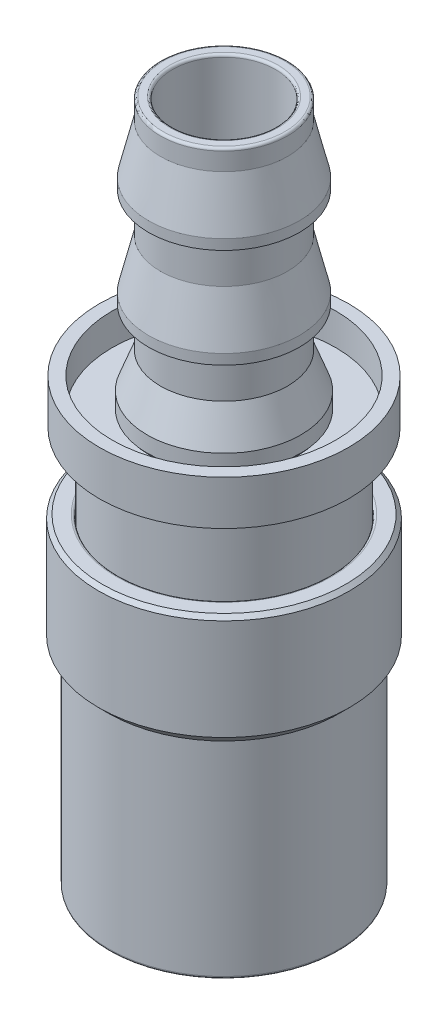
ISO-10303-21;
HEADER;
FILE_DESCRIPTION(('STEP AP214'),'2;1');
FILE_NAME('part.step','',(''),(''),'','','');
FILE_SCHEMA(('AUTOMOTIVE_DESIGN { 1 0 10303 214 1 1 1 1 }'));
ENDSEC;
DATA;
#1=APPLICATION_CONTEXT('core data for automotive mechanical design processes');
#2=APPLICATION_PROTOCOL_DEFINITION('international standard','automotive_design',2000,#1);
#3=PRODUCT_CONTEXT('',#1,'mechanical');
#4=PRODUCT('Part','Part','',(#3));
#5=PRODUCT_RELATED_PRODUCT_CATEGORY('part','',(#4));
#6=PRODUCT_DEFINITION_FORMATION('','',#4);
#7=PRODUCT_DEFINITION_CONTEXT('part definition',#1,'design');
#8=PRODUCT_DEFINITION('design','',#6,#7);
#9=PRODUCT_DEFINITION_SHAPE('','',#8);
#10=(LENGTH_UNIT() NAMED_UNIT(*) SI_UNIT(.MILLI.,.METRE.));
#11=(NAMED_UNIT(*) PLANE_ANGLE_UNIT() SI_UNIT($,.RADIAN.));
#12=(NAMED_UNIT(*) SI_UNIT($,.STERADIAN.) SOLID_ANGLE_UNIT());
#13=UNCERTAINTY_MEASURE_WITH_UNIT(LENGTH_MEASURE(1.E-05),#10,'distance_accuracy_value','');
#14=(GEOMETRIC_REPRESENTATION_CONTEXT(3) GLOBAL_UNCERTAINTY_ASSIGNED_CONTEXT((#13)) GLOBAL_UNIT_ASSIGNED_CONTEXT((#10,
#11,#12)) REPRESENTATION_CONTEXT('',''));
#15=CARTESIAN_POINT('',(0.,0.,0.));
#16=DIRECTION('',(0.,0.,1.));
#17=DIRECTION('',(1.,0.,0.));
#18=AXIS2_PLACEMENT_3D('',#15,#16,#17);
#19=CARTESIAN_POINT('',(0.,31.9405,0.));
#20=DIRECTION('',(0.,-1.,0.));
#21=DIRECTION('',(0.,0.,-1.));
#22=AXIS2_PLACEMENT_3D('',#19,#20,#21);
#23=CONICAL_SURFACE('',#22,12.3494480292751,0.785398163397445);
#24=CARTESIAN_POINT('',(0.,32.131,0.));
#25=DIRECTION('',(0.,-1.,0.));
#26=DIRECTION('',(0.,0.,-1.));
#27=AXIS2_PLACEMENT_3D('',#24,#25,#26);
#28=CIRCLE('',#27,12.1589480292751);
#29=CARTESIAN_POINT('',(0.,32.131,12.1589480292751));
#30=VERTEX_POINT('',#29);
#31=EDGE_CURVE('P0_E11',#30,#30,#28,.T.);
#32=ORIENTED_EDGE('',*,*,#31,.T.);
#33=DIRECTION('',(0.,-0.70710678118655,0.707106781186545));
#34=VECTOR('',#33,1.);
#35=CARTESIAN_POINT('',(0.,31.9405,12.3494480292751));
#36=LINE('',#35,#34);
#37=CARTESIAN_POINT('',(0.,31.75,12.5399480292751));
#38=VERTEX_POINT('',#37);
#39=EDGE_CURVE('P0_E27',#30,#38,#36,.T.);
#40=ORIENTED_EDGE('',*,*,#39,.T.);
#41=CARTESIAN_POINT('',(0.,31.75,0.));
#42=DIRECTION('',(0.,1.,0.));
#43=DIRECTION('',(0.,0.,-1.));
#44=AXIS2_PLACEMENT_3D('',#41,#42,#43);
#45=CIRCLE('',#44,12.5399480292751);
#46=CARTESIAN_POINT('',(0.,31.75,-12.5399480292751));
#47=VERTEX_POINT('',#46);
#48=EDGE_CURVE('P0_E277',#38,#47,#45,.T.);
#49=ORIENTED_EDGE('',*,*,#48,.T.);
#50=CARTESIAN_POINT('',(0.,31.75,0.));
#51=DIRECTION('',(0.,1.,0.));
#52=DIRECTION('',(0.,0.,-1.));
#53=AXIS2_PLACEMENT_3D('',#50,#51,#52);
#54=CIRCLE('',#53,12.5399480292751);
#55=EDGE_CURVE('P0_E239',#47,#38,#54,.T.);
#56=ORIENTED_EDGE('',*,*,#55,.T.);
#57=ORIENTED_EDGE('',*,*,#39,.F.);
#58=EDGE_LOOP('',(#32,#40,#49,#56,#57));
#59=FACE_BOUND('',#58,.T.);
#60=ADVANCED_FACE('P0_F16',(#59),#23,.T.);
#61=CARTESIAN_POINT('',(0.,32.131,10.541));
#62=DIRECTION('',(0.,1.,0.));
#63=DIRECTION('',(1.,0.,0.));
#64=AXIS2_PLACEMENT_3D('',#61,#62,#63);
#65=PLANE('',#64);
#66=ORIENTED_EDGE('',*,*,#31,.F.);
#67=EDGE_LOOP('',(#66));
#68=FACE_BOUND('',#67,.T.);
#69=CARTESIAN_POINT('',(0.,32.131,0.));
#70=DIRECTION('',(0.,1.,0.));
#71=DIRECTION('',(0.,0.,-1.));
#72=AXIS2_PLACEMENT_3D('',#69,#70,#71);
#73=CIRCLE('',#72,10.795);
#74=CARTESIAN_POINT('',(0.,32.131,10.795));
#75=VERTEX_POINT('',#74);
#76=CARTESIAN_POINT('',(0.,32.131,-10.795));
#77=VERTEX_POINT('',#76);
#78=EDGE_CURVE('P0_E192',#75,#77,#73,.T.);
#79=ORIENTED_EDGE('',*,*,#78,.F.);
#80=CARTESIAN_POINT('',(0.,32.131,0.));
#81=DIRECTION('',(0.,1.,0.));
#82=DIRECTION('',(0.,0.,-1.));
#83=AXIS2_PLACEMENT_3D('',#80,#81,#82);
#84=CIRCLE('',#83,10.795);
#85=EDGE_CURVE('P0_E200',#77,#75,#84,.T.);
#86=ORIENTED_EDGE('',*,*,#85,.F.);
#87=EDGE_LOOP('',(#79,#86));
#88=FACE_BOUND('',#87,.T.);
#89=ADVANCED_FACE('P0_F392',(#68,#88),#65,.T.);
#90=CARTESIAN_POINT('',(0.,26.8947740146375,0.));
#91=DIRECTION('',(0.,1.,0.));
#92=DIRECTION('',(0.,0.,1.));
#93=AXIS2_PLACEMENT_3D('',#90,#91,#92);
#94=CYLINDRICAL_SURFACE('',#93,12.5399480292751);
#95=ORIENTED_EDGE('',*,*,#48,.F.);
#96=ORIENTED_EDGE('',*,*,#55,.F.);
#97=DIRECTION('',(0.,-1.,0.));
#98=VECTOR('',#97,1.);
#99=CARTESIAN_POINT('',(0.,26.8947740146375,-12.5399480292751));
#100=LINE('',#99,#98);
#101=CARTESIAN_POINT('',(0.,21.6585480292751,-12.5399480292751));
#102=VERTEX_POINT('',#101);
#103=EDGE_CURVE('P0_E228',#47,#102,#100,.T.);
#104=ORIENTED_EDGE('',*,*,#103,.T.);
#105=CARTESIAN_POINT('',(0.,21.6585480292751,0.));
#106=DIRECTION('',(0.,1.,0.));
#107=DIRECTION('',(1.,0.,0.));
#108=AXIS2_PLACEMENT_3D('',#105,#106,#107);
#109=CIRCLE('',#108,12.5399480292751);
#110=CARTESIAN_POINT('',(0.,21.6585480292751,12.5399480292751));
#111=VERTEX_POINT('',#110);
#112=EDGE_CURVE('P0_E225',#102,#111,#109,.T.);
#113=ORIENTED_EDGE('',*,*,#112,.T.);
#114=CARTESIAN_POINT('',(0.,21.6585480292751,0.));
#115=DIRECTION('',(0.,1.,0.));
#116=DIRECTION('',(1.,0.,0.));
#117=AXIS2_PLACEMENT_3D('',#114,#115,#116);
#118=CIRCLE('',#117,12.5399480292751);
#119=EDGE_CURVE('P0_E229',#111,#102,#118,.T.);
#120=ORIENTED_EDGE('',*,*,#119,.T.);
#121=ORIENTED_EDGE('',*,*,#103,.F.);
#122=EDGE_LOOP('',(#95,#96,#104,#113,#120,#121));
#123=FACE_BOUND('',#122,.T.);
#124=ADVANCED_FACE('P0_F373',(#123),#94,.T.);
#125=CARTESIAN_POINT('',(0.,0.254,0.));
#126=DIRECTION('',(0.,1.,0.));
#127=DIRECTION('',(0.,0.,1.));
#128=AXIS2_PLACEMENT_3D('',#125,#126,#127);
#129=TOROIDAL_SURFACE('',#128,11.2522,0.254);
#130=CARTESIAN_POINT('',(0.,0.254,0.));
#131=DIRECTION('',(0.,-1.,0.));
#132=DIRECTION('',(0.,0.,-1.));
#133=AXIS2_PLACEMENT_3D('',#130,#131,#132);
#134=CIRCLE('',#133,11.5062);
#135=CARTESIAN_POINT('',(0.,0.254,11.5062));
#136=VERTEX_POINT('',#135);
#137=CARTESIAN_POINT('',(0.,0.254,-11.5062));
#138=VERTEX_POINT('',#137);
#139=EDGE_CURVE('P0_E240',#136,#138,#134,.T.);
#140=ORIENTED_EDGE('',*,*,#139,.T.);
#141=CARTESIAN_POINT('',(0.,0.254,-11.2522));
#142=DIRECTION('',(-1.,0.,0.));
#143=DIRECTION('',(0.,0.,-1.));
#144=AXIS2_PLACEMENT_3D('',#141,#142,#143);
#145=CIRCLE('',#144,0.254);
#146=CARTESIAN_POINT('',(0.,0.,-11.2522));
#147=VERTEX_POINT('',#146);
#148=EDGE_CURVE('P0_E244',#138,#147,#145,.T.);
#149=ORIENTED_EDGE('',*,*,#148,.T.);
#150=CARTESIAN_POINT('',(0.,0.,0.));
#151=DIRECTION('',(0.,1.,0.));
#152=DIRECTION('',(0.,0.,-1.));
#153=AXIS2_PLACEMENT_3D('',#150,#151,#152);
#154=CIRCLE('',#153,11.2522);
#155=CARTESIAN_POINT('',(0.,0.,11.2522));
#156=VERTEX_POINT('',#155);
#157=EDGE_CURVE('P0_E113',#147,#156,#154,.T.);
#158=ORIENTED_EDGE('',*,*,#157,.T.);
#159=CARTESIAN_POINT('',(0.,0.,0.));
#160=DIRECTION('',(0.,1.,0.));
#161=DIRECTION('',(0.,0.,-1.));
#162=AXIS2_PLACEMENT_3D('',#159,#160,#161);
#163=CIRCLE('',#162,11.2522);
#164=EDGE_CURVE('P0_E330',#156,#147,#163,.T.);
#165=ORIENTED_EDGE('',*,*,#164,.T.);
#166=ORIENTED_EDGE('',*,*,#148,.F.);
#167=CARTESIAN_POINT('',(0.,0.254,0.));
#168=DIRECTION('',(0.,-1.,0.));
#169=DIRECTION('',(0.,0.,-1.));
#170=AXIS2_PLACEMENT_3D('',#167,#168,#169);
#171=CIRCLE('',#170,11.5062);
#172=EDGE_CURVE('P0_E20',#138,#136,#171,.T.);
#173=ORIENTED_EDGE('',*,*,#172,.T.);
#174=EDGE_LOOP('',(#140,#149,#158,#165,#166,#173));
#175=FACE_BOUND('',#174,.T.);
#176=ADVANCED_FACE('P0_F18',(#175),#129,.T.);
#177=CARTESIAN_POINT('',(0.,0.,11.5062));
#178=DIRECTION('',(0.,-1.,0.));
#179=DIRECTION('',(0.,0.,-1.));
#180=AXIS2_PLACEMENT_3D('',#177,#178,#179);
#181=PLANE('',#180);
#182=ORIENTED_EDGE('',*,*,#164,.F.);
#183=ORIENTED_EDGE('',*,*,#157,.F.);
#184=EDGE_LOOP('',(#182,#183));
#185=FACE_BOUND('',#184,.T.);
#186=CARTESIAN_POINT('',(0.,0.,0.));
#187=DIRECTION('',(0.,-1.,0.));
#188=DIRECTION('',(0.,0.,-1.));
#189=AXIS2_PLACEMENT_3D('',#186,#187,#188);
#190=CIRCLE('',#189,10.3124003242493);
#191=CARTESIAN_POINT('',(0.,0.,10.3124003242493));
#192=VERTEX_POINT('',#191);
#193=CARTESIAN_POINT('',(0.,0.,-10.3124003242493));
#194=VERTEX_POINT('',#193);
#195=EDGE_CURVE('P0_E245',#192,#194,#190,.T.);
#196=ORIENTED_EDGE('',*,*,#195,.F.);
#197=CARTESIAN_POINT('',(0.,0.,0.));
#198=DIRECTION('',(0.,-1.,0.));
#199=DIRECTION('',(0.,0.,-1.));
#200=AXIS2_PLACEMENT_3D('',#197,#198,#199);
#201=CIRCLE('',#200,10.3124003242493);
#202=EDGE_CURVE('P0_E255',#194,#192,#201,.T.);
#203=ORIENTED_EDGE('',*,*,#202,.F.);
#204=EDGE_LOOP('',(#196,#203));
#205=FACE_BOUND('',#204,.T.);
#206=ADVANCED_FACE('P0_F384',(#185,#205),#181,.T.);
#207=CARTESIAN_POINT('',(0.,10.3124,0.));
#208=DIRECTION('',(0.,1.,0.));
#209=DIRECTION('',(0.,0.,1.));
#210=AXIS2_PLACEMENT_3D('',#207,#208,#209);
#211=CYLINDRICAL_SURFACE('',#210,11.5062);
#212=CARTESIAN_POINT('',(0.,20.6248,0.));
#213=DIRECTION('',(0.,1.,0.));
#214=DIRECTION('',(1.,0.,0.));
#215=AXIS2_PLACEMENT_3D('',#212,#213,#214);
#216=CIRCLE('',#215,11.5062);
#217=CARTESIAN_POINT('',(0.,20.6248,11.5062));
#218=VERTEX_POINT('',#217);
#219=CARTESIAN_POINT('',(0.,20.6248,-11.5062));
#220=VERTEX_POINT('',#219);
#221=EDGE_CURVE('P0_E273',#218,#220,#216,.T.);
#222=ORIENTED_EDGE('',*,*,#221,.F.);
#223=CARTESIAN_POINT('',(0.,20.6248,0.));
#224=DIRECTION('',(0.,1.,0.));
#225=DIRECTION('',(1.,0.,0.));
#226=AXIS2_PLACEMENT_3D('',#223,#224,#225);
#227=CIRCLE('',#226,11.5062);
#228=EDGE_CURVE('P0_E268',#220,#218,#227,.T.);
#229=ORIENTED_EDGE('',*,*,#228,.F.);
#230=DIRECTION('',(0.,-1.,0.));
#231=VECTOR('',#230,1.);
#232=CARTESIAN_POINT('',(0.,10.3124,-11.5062));
#233=LINE('',#232,#231);
#234=EDGE_CURVE('P0_E203',#220,#138,#233,.T.);
#235=ORIENTED_EDGE('',*,*,#234,.T.);
#236=ORIENTED_EDGE('',*,*,#139,.F.);
#237=ORIENTED_EDGE('',*,*,#172,.F.);
#238=ORIENTED_EDGE('',*,*,#234,.F.);
#239=EDGE_LOOP('',(#222,#229,#235,#236,#237,#238));
#240=FACE_BOUND('',#239,.T.);
#241=ADVANCED_FACE('P0_F382',(#240),#211,.T.);
#242=CARTESIAN_POINT('',(0.,31.877,0.));
#243=DIRECTION('',(0.,1.,0.));
#244=DIRECTION('',(0.,0.,1.));
#245=AXIS2_PLACEMENT_3D('',#242,#243,#244);
#246=TOROIDAL_SURFACE('',#245,10.795,0.254);
#247=CARTESIAN_POINT('',(0.,31.877,0.));
#248=DIRECTION('',(0.,-1.,0.));
#249=DIRECTION('',(0.,0.,-1.));
#250=AXIS2_PLACEMENT_3D('',#247,#248,#249);
#251=CIRCLE('',#250,10.541);
#252=CARTESIAN_POINT('',(0.,31.877,10.541));
#253=VERTEX_POINT('',#252);
#254=CARTESIAN_POINT('',(0.,31.877,-10.541));
#255=VERTEX_POINT('',#254);
#256=EDGE_CURVE('P0_E189',#253,#255,#251,.T.);
#257=ORIENTED_EDGE('',*,*,#256,.T.);
#258=CARTESIAN_POINT('',(0.,31.877,-10.795));
#259=DIRECTION('',(-1.,0.,0.));
#260=DIRECTION('',(0.,0.,-1.));
#261=AXIS2_PLACEMENT_3D('',#258,#259,#260);
#262=CIRCLE('',#261,0.254);
#263=EDGE_CURVE('P0_E195',#255,#77,#262,.T.);
#264=ORIENTED_EDGE('',*,*,#263,.T.);
#265=ORIENTED_EDGE('',*,*,#85,.T.);
#266=ORIENTED_EDGE('',*,*,#78,.T.);
#267=ORIENTED_EDGE('',*,*,#263,.F.);
#268=CARTESIAN_POINT('',(0.,31.877,0.));
#269=DIRECTION('',(0.,-1.,0.));
#270=DIRECTION('',(0.,0.,-1.));
#271=AXIS2_PLACEMENT_3D('',#268,#269,#270);
#272=CIRCLE('',#271,10.541);
#273=EDGE_CURVE('P0_E182',#255,#253,#272,.T.);
#274=ORIENTED_EDGE('',*,*,#273,.T.);
#275=EDGE_LOOP('',(#257,#264,#265,#266,#267,#274));
#276=FACE_BOUND('',#275,.T.);
#277=ADVANCED_FACE('P0_F196',(#276),#246,.T.);
#278=CARTESIAN_POINT('',(0.,19.3675,0.));
#279=DIRECTION('',(0.,1.,0.));
#280=DIRECTION('',(0.,0.,1.));
#281=AXIS2_PLACEMENT_3D('',#278,#279,#280);
#282=CYLINDRICAL_SURFACE('',#281,10.541);
#283=ORIENTED_EDGE('',*,*,#256,.F.);
#284=ORIENTED_EDGE('',*,*,#273,.F.);
#285=DIRECTION('',(0.,-1.,0.));
#286=VECTOR('',#285,1.);
#287=CARTESIAN_POINT('',(0.,19.3675,-10.541));
#288=LINE('',#287,#286);
#289=CARTESIAN_POINT('',(0.,7.366,-10.541));
#290=VERTEX_POINT('',#289);
#291=EDGE_CURVE('P0_E186',#255,#290,#288,.T.);
#292=ORIENTED_EDGE('',*,*,#291,.T.);
#293=CARTESIAN_POINT('',(0.,7.366,0.));
#294=DIRECTION('',(0.,1.,0.));
#295=DIRECTION('',(0.,0.,-1.));
#296=AXIS2_PLACEMENT_3D('',#293,#294,#295);
#297=CIRCLE('',#296,10.541);
#298=CARTESIAN_POINT('',(0.,7.366,10.541));
#299=VERTEX_POINT('',#298);
#300=EDGE_CURVE('P0_E209',#299,#290,#297,.T.);
#301=ORIENTED_EDGE('',*,*,#300,.F.);
#302=CARTESIAN_POINT('',(0.,7.366,0.));
#303=DIRECTION('',(0.,1.,0.));
#304=DIRECTION('',(0.,0.,-1.));
#305=AXIS2_PLACEMENT_3D('',#302,#303,#304);
#306=CIRCLE('',#305,10.541);
#307=EDGE_CURVE('P0_E206',#290,#299,#306,.T.);
#308=ORIENTED_EDGE('',*,*,#307,.F.);
#309=ORIENTED_EDGE('',*,*,#291,.F.);
#310=EDGE_LOOP('',(#283,#284,#292,#301,#308,#309));
#311=FACE_BOUND('',#310,.T.);
#312=ADVANCED_FACE('P0_F184',(#311),#282,.F.);
#313=CARTESIAN_POINT('',(0.,7.366,0.));
#314=DIRECTION('',(0.,1.,0.));
#315=DIRECTION('',(0.,0.,1.));
#316=AXIS2_PLACEMENT_3D('',#313,#314,#315);
#317=TOROIDAL_SURFACE('',#316,9.779,0.762);
#318=ORIENTED_EDGE('',*,*,#300,.T.);
#319=CARTESIAN_POINT('',(0.,7.366,-9.779));
#320=DIRECTION('',(-1.,0.,0.));
#321=DIRECTION('',(0.,0.,-1.));
#322=AXIS2_PLACEMENT_3D('',#319,#320,#321);
#323=CIRCLE('',#322,0.762);
#324=CARTESIAN_POINT('',(0.,6.604,-9.779));
#325=VERTEX_POINT('',#324);
#326=EDGE_CURVE('P0_E215',#290,#325,#323,.T.);
#327=ORIENTED_EDGE('',*,*,#326,.T.);
#328=CARTESIAN_POINT('',(0.,6.604,0.));
#329=DIRECTION('',(0.,-1.,0.));
#330=DIRECTION('',(0.,0.,-1.));
#331=AXIS2_PLACEMENT_3D('',#328,#329,#330);
#332=CIRCLE('',#331,9.779);
#333=CARTESIAN_POINT('',(0.,6.604,9.779));
#334=VERTEX_POINT('',#333);
#335=EDGE_CURVE('P0_E219',#325,#334,#332,.T.);
#336=ORIENTED_EDGE('',*,*,#335,.T.);
#337=CARTESIAN_POINT('',(0.,6.604,0.));
#338=DIRECTION('',(0.,-1.,0.));
#339=DIRECTION('',(0.,0.,-1.));
#340=AXIS2_PLACEMENT_3D('',#337,#338,#339);
#341=CIRCLE('',#340,9.779);
#342=EDGE_CURVE('P0_E223',#334,#325,#341,.T.);
#343=ORIENTED_EDGE('',*,*,#342,.T.);
#344=ORIENTED_EDGE('',*,*,#326,.F.);
#345=ORIENTED_EDGE('',*,*,#307,.T.);
#346=EDGE_LOOP('',(#318,#327,#336,#343,#344,#345));
#347=FACE_BOUND('',#346,.T.);
#348=ADVANCED_FACE('P0_F588',(#347),#317,.F.);
#349=CARTESIAN_POINT('',(0.,6.604,9.017));
#350=DIRECTION('',(0.,1.,0.));
#351=DIRECTION('',(1.,0.,0.));
#352=AXIS2_PLACEMENT_3D('',#349,#350,#351);
#353=PLANE('',#352);
#354=ORIENTED_EDGE('',*,*,#342,.F.);
#355=ORIENTED_EDGE('',*,*,#335,.F.);
#356=EDGE_LOOP('',(#354,#355));
#357=FACE_BOUND('',#356,.T.);
#358=CARTESIAN_POINT('',(0.,6.604,0.));
#359=DIRECTION('',(0.,1.,0.));
#360=DIRECTION('',(0.,0.,-1.));
#361=AXIS2_PLACEMENT_3D('',#358,#359,#360);
#362=CIRCLE('',#361,9.398);
#363=CARTESIAN_POINT('',(0.,6.604,9.398));
#364=VERTEX_POINT('',#363);
#365=CARTESIAN_POINT('',(0.,6.604,-9.398));
#366=VERTEX_POINT('',#365);
#367=EDGE_CURVE('P0_E351',#364,#366,#362,.T.);
#368=ORIENTED_EDGE('',*,*,#367,.F.);
#369=CARTESIAN_POINT('',(0.,6.604,0.));
#370=DIRECTION('',(0.,1.,0.));
#371=DIRECTION('',(0.,0.,-1.));
#372=AXIS2_PLACEMENT_3D('',#369,#370,#371);
#373=CIRCLE('',#372,9.398);
#374=EDGE_CURVE('P0_E288',#366,#364,#373,.T.);
#375=ORIENTED_EDGE('',*,*,#374,.F.);
#376=EDGE_LOOP('',(#368,#375));
#377=FACE_BOUND('',#376,.T.);
#378=ADVANCED_FACE('P0_F582',(#357,#377),#353,.T.);
#379=CARTESIAN_POINT('',(0.,2.61800544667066,0.));
#380=DIRECTION('',(0.,1.,0.));
#381=DIRECTION('',(0.,0.,1.));
#382=AXIS2_PLACEMENT_3D('',#379,#380,#381);
#383=TOROIDAL_SURFACE('',#382,9.144,0.127);
#384=CARTESIAN_POINT('',(0.,2.52820288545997,0.));
#385=DIRECTION('',(0.,-1.,0.));
#386=DIRECTION('',(0.,0.,-1.));
#387=AXIS2_PLACEMENT_3D('',#384,#385,#386);
#388=CIRCLE('',#387,9.0541974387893);
#389=CARTESIAN_POINT('',(0.,2.52820288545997,9.0541974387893));
#390=VERTEX_POINT('',#389);
#391=CARTESIAN_POINT('',(0.,2.52820288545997,-9.0541974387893));
#392=VERTEX_POINT('',#391);
#393=EDGE_CURVE('P0_E224',#390,#392,#388,.T.);
#394=ORIENTED_EDGE('',*,*,#393,.T.);
#395=CARTESIAN_POINT('',(0.,2.61800544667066,-9.144));
#396=DIRECTION('',(-1.,0.,0.));
#397=DIRECTION('',(0.,0.,-1.));
#398=AXIS2_PLACEMENT_3D('',#395,#396,#397);
#399=CIRCLE('',#398,0.127);
#400=CARTESIAN_POINT('',(0.,2.61800544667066,-9.017));
#401=VERTEX_POINT('',#400);
#402=EDGE_CURVE('P0_E230',#392,#401,#399,.T.);
#403=ORIENTED_EDGE('',*,*,#402,.T.);
#404=CARTESIAN_POINT('',(0.,2.61800544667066,0.));
#405=DIRECTION('',(0.,1.,0.));
#406=DIRECTION('',(0.,0.,-1.));
#407=AXIS2_PLACEMENT_3D('',#404,#405,#406);
#408=CIRCLE('',#407,9.017);
#409=CARTESIAN_POINT('',(0.,2.61800544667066,9.017));
#410=VERTEX_POINT('',#409);
#411=EDGE_CURVE('P0_E82',#401,#410,#408,.T.);
#412=ORIENTED_EDGE('',*,*,#411,.T.);
#413=CARTESIAN_POINT('',(0.,2.61800544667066,0.));
#414=DIRECTION('',(0.,1.,0.));
#415=DIRECTION('',(0.,0.,-1.));
#416=AXIS2_PLACEMENT_3D('',#413,#414,#415);
#417=CIRCLE('',#416,9.017);
#418=EDGE_CURVE('P0_E69',#410,#401,#417,.T.);
#419=ORIENTED_EDGE('',*,*,#418,.T.);
#420=ORIENTED_EDGE('',*,*,#402,.F.);
#421=CARTESIAN_POINT('',(0.,2.52820288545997,0.));
#422=DIRECTION('',(0.,-1.,0.));
#423=DIRECTION('',(0.,0.,-1.));
#424=AXIS2_PLACEMENT_3D('',#421,#422,#423);
#425=CIRCLE('',#424,9.0541974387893);
#426=EDGE_CURVE('P0_E235',#392,#390,#425,.T.);
#427=ORIENTED_EDGE('',*,*,#426,.T.);
#428=EDGE_LOOP('',(#394,#403,#412,#419,#420,#427));
#429=FACE_BOUND('',#428,.T.);
#430=ADVANCED_FACE('P0_F407',(#429),#383,.T.);
#431=CARTESIAN_POINT('',(0.,1.99390016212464,0.));
#432=DIRECTION('',(0.,-1.,0.));
#433=DIRECTION('',(0.,0.,1.));
#434=AXIS2_PLACEMENT_3D('',#431,#432,#433);
#435=CONICAL_SURFACE('',#434,9.58850016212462,0.785398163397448);
#436=ORIENTED_EDGE('',*,*,#393,.F.);
#437=ORIENTED_EDGE('',*,*,#426,.F.);
#438=DIRECTION('',(0.,-0.707106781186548,-0.707106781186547));
#439=VECTOR('',#438,1.);
#440=CARTESIAN_POINT('',(0.,1.99390016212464,-9.58850016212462));
#441=LINE('',#440,#439);
#442=CARTESIAN_POINT('',(0.,1.64558463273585,-9.93681569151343));
#443=VERTEX_POINT('',#442);
#444=EDGE_CURVE('P0_E305',#392,#443,#441,.T.);
#445=ORIENTED_EDGE('',*,*,#444,.T.);
#446=CARTESIAN_POINT('',(0.,1.64558463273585,0.));
#447=DIRECTION('',(0.,1.,0.));
#448=DIRECTION('',(0.,0.,-1.));
#449=AXIS2_PLACEMENT_3D('',#446,#447,#448);
#450=CIRCLE('',#449,9.93681569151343);
#451=CARTESIAN_POINT('',(0.,1.64558463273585,9.93681569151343));
#452=VERTEX_POINT('',#451);
#453=EDGE_CURVE('P0_E278',#452,#443,#450,.T.);
#454=ORIENTED_EDGE('',*,*,#453,.F.);
#455=CARTESIAN_POINT('',(0.,1.64558463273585,0.));
#456=DIRECTION('',(0.,1.,0.));
#457=DIRECTION('',(0.,0.,-1.));
#458=AXIS2_PLACEMENT_3D('',#455,#456,#457);
#459=CIRCLE('',#458,9.93681569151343);
#460=EDGE_CURVE('P0_E296',#443,#452,#459,.T.);
#461=ORIENTED_EDGE('',*,*,#460,.F.);
#462=ORIENTED_EDGE('',*,*,#444,.F.);
#463=EDGE_LOOP('',(#436,#437,#445,#454,#461,#462));
#464=FACE_BOUND('',#463,.T.);
#465=ADVANCED_FACE('P0_F405',(#464),#435,.F.);
#466=CARTESIAN_POINT('',(0.,4.58470016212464,0.));
#467=DIRECTION('',(0.,1.,0.));
#468=DIRECTION('',(0.,0.,1.));
#469=AXIS2_PLACEMENT_3D('',#466,#467,#468);
#470=CYLINDRICAL_SURFACE('',#469,9.017);
#471=CARTESIAN_POINT('',(0.,6.223,0.));
#472=DIRECTION('',(0.,-1.,0.));
#473=DIRECTION('',(0.,0.,-1.));
#474=AXIS2_PLACEMENT_3D('',#471,#472,#473);
#475=CIRCLE('',#474,9.017);
#476=CARTESIAN_POINT('',(0.,6.223,9.017));
#477=VERTEX_POINT('',#476);
#478=CARTESIAN_POINT('',(0.,6.223,-9.017));
#479=VERTEX_POINT('',#478);
#480=EDGE_CURVE('P0_E251',#477,#479,#475,.T.);
#481=ORIENTED_EDGE('',*,*,#480,.F.);
#482=CARTESIAN_POINT('',(0.,6.223,0.));
#483=DIRECTION('',(0.,-1.,0.));
#484=DIRECTION('',(0.,0.,-1.));
#485=AXIS2_PLACEMENT_3D('',#482,#483,#484);
#486=CIRCLE('',#485,9.017);
#487=EDGE_CURVE('P0_E310',#479,#477,#486,.T.);
#488=ORIENTED_EDGE('',*,*,#487,.F.);
#489=DIRECTION('',(0.,-1.,0.));
#490=VECTOR('',#489,1.);
#491=CARTESIAN_POINT('',(0.,4.58470016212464,-9.017));
#492=LINE('',#491,#490);
#493=EDGE_CURVE('P0_E282',#479,#401,#492,.T.);
#494=ORIENTED_EDGE('',*,*,#493,.T.);
#495=ORIENTED_EDGE('',*,*,#418,.F.);
#496=ORIENTED_EDGE('',*,*,#411,.F.);
#497=ORIENTED_EDGE('',*,*,#493,.F.);
#498=EDGE_LOOP('',(#481,#488,#494,#495,#496,#497));
#499=FACE_BOUND('',#498,.T.);
#500=ADVANCED_FACE('P0_F403',(#499),#470,.F.);
#501=CARTESIAN_POINT('',(0.,1.1067692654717,0.));
#502=DIRECTION('',(0.,1.,0.));
#503=DIRECTION('',(0.,0.,1.));
#504=AXIS2_PLACEMENT_3D('',#501,#502,#503);
#505=TOROIDAL_SURFACE('',#504,9.39800032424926,0.762);
#506=ORIENTED_EDGE('',*,*,#453,.T.);
#507=CARTESIAN_POINT('',(0.,1.1067692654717,-9.39800032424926));
#508=DIRECTION('',(-1.,0.,0.));
#509=DIRECTION('',(0.,0.,-1.));
#510=AXIS2_PLACEMENT_3D('',#507,#508,#509);
#511=CIRCLE('',#510,0.762);
#512=CARTESIAN_POINT('',(0.,1.1067692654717,-10.1600003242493));
#513=VERTEX_POINT('',#512);
#514=EDGE_CURVE('P0_E262',#443,#513,#511,.T.);
#515=ORIENTED_EDGE('',*,*,#514,.T.);
#516=CARTESIAN_POINT('',(0.,1.1067692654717,0.));
#517=DIRECTION('',(0.,-1.,0.));
#518=DIRECTION('',(0.,0.,-1.));
#519=AXIS2_PLACEMENT_3D('',#516,#517,#518);
#520=CIRCLE('',#519,10.1600003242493);
#521=CARTESIAN_POINT('',(0.,1.1067692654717,10.1600003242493));
#522=VERTEX_POINT('',#521);
#523=EDGE_CURVE('P0_E259',#513,#522,#520,.T.);
#524=ORIENTED_EDGE('',*,*,#523,.T.);
#525=CARTESIAN_POINT('',(0.,1.1067692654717,0.));
#526=DIRECTION('',(0.,-1.,0.));
#527=DIRECTION('',(0.,0.,-1.));
#528=AXIS2_PLACEMENT_3D('',#525,#526,#527);
#529=CIRCLE('',#528,10.1600003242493);
#530=EDGE_CURVE('P0_E263',#522,#513,#529,.T.);
#531=ORIENTED_EDGE('',*,*,#530,.T.);
#532=ORIENTED_EDGE('',*,*,#514,.F.);
#533=ORIENTED_EDGE('',*,*,#460,.T.);
#534=EDGE_LOOP('',(#506,#515,#524,#531,#532,#533));
#535=FACE_BOUND('',#534,.T.);
#536=ADVANCED_FACE('P0_F409',(#535),#505,.F.);
#537=CARTESIAN_POINT('',(0.,0.7112,0.));
#538=DIRECTION('',(0.,1.,0.));
#539=DIRECTION('',(0.,0.,1.));
#540=AXIS2_PLACEMENT_3D('',#537,#538,#539);
#541=CYLINDRICAL_SURFACE('',#540,10.1600003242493);
#542=ORIENTED_EDGE('',*,*,#530,.F.);
#543=ORIENTED_EDGE('',*,*,#523,.F.);
#544=DIRECTION('',(0.,-1.,0.));
#545=VECTOR('',#544,1.);
#546=CARTESIAN_POINT('',(0.,0.7112,-10.1600003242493));
#547=LINE('',#546,#545);
#548=CARTESIAN_POINT('',(0.,0.1524,-10.1600003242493));
#549=VERTEX_POINT('',#548);
#550=EDGE_CURVE('P0_E249',#513,#549,#547,.T.);
#551=ORIENTED_EDGE('',*,*,#550,.T.);
#552=CARTESIAN_POINT('',(0.,0.1524,0.));
#553=DIRECTION('',(0.,1.,0.));
#554=DIRECTION('',(0.,0.,-1.));
#555=AXIS2_PLACEMENT_3D('',#552,#553,#554);
#556=CIRCLE('',#555,10.1600003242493);
#557=CARTESIAN_POINT('',(0.,0.1524,10.1600003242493));
#558=VERTEX_POINT('',#557);
#559=EDGE_CURVE('P0_E292',#558,#549,#556,.T.);
#560=ORIENTED_EDGE('',*,*,#559,.F.);
#561=CARTESIAN_POINT('',(0.,0.1524,0.));
#562=DIRECTION('',(0.,1.,0.));
#563=DIRECTION('',(0.,0.,-1.));
#564=AXIS2_PLACEMENT_3D('',#561,#562,#563);
#565=CIRCLE('',#564,10.1600003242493);
#566=EDGE_CURVE('P0_E267',#549,#558,#565,.T.);
#567=ORIENTED_EDGE('',*,*,#566,.F.);
#568=ORIENTED_EDGE('',*,*,#550,.F.);
#569=EDGE_LOOP('',(#542,#543,#551,#560,#567,#568));
#570=FACE_BOUND('',#569,.T.);
#571=ADVANCED_FACE('P0_F411',(#570),#541,.F.);
#572=CARTESIAN_POINT('',(0.,0.1524,0.));
#573=DIRECTION('',(0.,1.,0.));
#574=DIRECTION('',(0.,0.,1.));
#575=AXIS2_PLACEMENT_3D('',#572,#573,#574);
#576=TOROIDAL_SURFACE('',#575,10.3124003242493,0.1524);
#577=ORIENTED_EDGE('',*,*,#195,.T.);
#578=CARTESIAN_POINT('',(0.,0.1524,-10.3124003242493));
#579=DIRECTION('',(-1.,0.,0.));
#580=DIRECTION('',(0.,0.,-1.));
#581=AXIS2_PLACEMENT_3D('',#578,#579,#580);
#582=CIRCLE('',#581,0.1524);
#583=EDGE_CURVE('P0_E250',#194,#549,#582,.T.);
#584=ORIENTED_EDGE('',*,*,#583,.T.);
#585=ORIENTED_EDGE('',*,*,#566,.T.);
#586=ORIENTED_EDGE('',*,*,#559,.T.);
#587=ORIENTED_EDGE('',*,*,#583,.F.);
#588=ORIENTED_EDGE('',*,*,#202,.T.);
#589=EDGE_LOOP('',(#577,#584,#585,#586,#587,#588));
#590=FACE_BOUND('',#589,.T.);
#591=ADVANCED_FACE('P0_F418',(#590),#576,.T.);
#592=CARTESIAN_POINT('',(0.,6.223,0.));
#593=DIRECTION('',(0.,1.,0.));
#594=DIRECTION('',(0.,0.,1.));
#595=AXIS2_PLACEMENT_3D('',#592,#593,#594);
#596=TOROIDAL_SURFACE('',#595,9.398,0.381);
#597=ORIENTED_EDGE('',*,*,#480,.T.);
#598=CARTESIAN_POINT('',(0.,6.223,-9.398));
#599=DIRECTION('',(-1.,0.,0.));
#600=DIRECTION('',(0.,0.,-1.));
#601=AXIS2_PLACEMENT_3D('',#598,#599,#600);
#602=CIRCLE('',#601,0.381);
#603=EDGE_CURVE('P0_E256',#479,#366,#602,.T.);
#604=ORIENTED_EDGE('',*,*,#603,.T.);
#605=ORIENTED_EDGE('',*,*,#374,.T.);
#606=ORIENTED_EDGE('',*,*,#367,.T.);
#607=ORIENTED_EDGE('',*,*,#603,.F.);
#608=ORIENTED_EDGE('',*,*,#487,.T.);
#609=EDGE_LOOP('',(#597,#604,#605,#606,#607,#608));
#610=FACE_BOUND('',#609,.T.);
#611=ADVANCED_FACE('P0_F476',(#610),#596,.T.);
#612=CARTESIAN_POINT('',(0.,21.1416740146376,0.));
#613=DIRECTION('',(0.,1.,0.));
#614=DIRECTION('',(0.,0.,1.));
#615=AXIS2_PLACEMENT_3D('',#612,#613,#614);
#616=CONICAL_SURFACE('',#615,12.0230740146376,0.785398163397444);
#617=ORIENTED_EDGE('',*,*,#119,.F.);
#618=ORIENTED_EDGE('',*,*,#112,.F.);
#619=DIRECTION('',(0.,-0.707106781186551,0.707106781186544));
#620=VECTOR('',#619,1.);
#621=CARTESIAN_POINT('',(0.,21.1416740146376,-12.0230740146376));
#622=LINE('',#621,#620);
#623=EDGE_CURVE('P0_E272',#102,#220,#622,.T.);
#624=ORIENTED_EDGE('',*,*,#623,.T.);
#625=ORIENTED_EDGE('',*,*,#228,.T.);
#626=ORIENTED_EDGE('',*,*,#221,.T.);
#627=ORIENTED_EDGE('',*,*,#623,.F.);
#628=EDGE_LOOP('',(#617,#618,#624,#625,#626,#627));
#629=FACE_BOUND('',#628,.T.);
#630=ADVANCED_FACE('P0_F378',(#629),#616,.T.);
#631=CLOSED_SHELL('',(#60,#89,#124,#176,#206,#241,#277,#312,#348,#378,#430,#465,#500,#536,#571,
#591,#611,#630));
#632=MANIFOLD_SOLID_BREP('P0_B1',#631);
#633=CARTESIAN_POINT('',(0.,0.254,0.));
#634=DIRECTION('',(0.,1.,0.));
#635=DIRECTION('',(0.,0.,1.));
#636=AXIS2_PLACEMENT_3D('',#633,#634,#635);
#637=TOROIDAL_SURFACE('',#636,8.6995,0.254);
#638=CARTESIAN_POINT('',(0.,0.254,0.));
#639=DIRECTION('',(0.,-1.,0.));
#640=DIRECTION('',(1.,0.,0.));
#641=AXIS2_PLACEMENT_3D('',#638,#639,#640);
#642=CIRCLE('',#641,8.9535);
#643=CARTESIAN_POINT('',(-8.9535,0.254,0.));
#644=VERTEX_POINT('',#643);
#645=CARTESIAN_POINT('',(0.,0.254,-8.9535));
#646=VERTEX_POINT('',#645);
#647=EDGE_CURVE('P1_E11',#644,#646,#642,.T.);
#648=ORIENTED_EDGE('',*,*,#647,.T.);
#649=CARTESIAN_POINT('',(0.,0.254,-8.6995));
#650=DIRECTION('',(-1.,0.,0.));
#651=DIRECTION('',(0.,0.,-1.));
#652=AXIS2_PLACEMENT_3D('',#649,#650,#651);
#653=CIRCLE('',#652,0.254);
#654=CARTESIAN_POINT('',(0.,0.,-8.6995));
#655=VERTEX_POINT('',#654);
#656=EDGE_CURVE('P1_E27',#646,#655,#653,.T.);
#657=ORIENTED_EDGE('',*,*,#656,.T.);
#658=CARTESIAN_POINT('',(0.,0.,0.));
#659=DIRECTION('',(0.,1.,0.));
#660=DIRECTION('',(1.,0.,0.));
#661=AXIS2_PLACEMENT_3D('',#658,#659,#660);
#662=CIRCLE('',#661,8.6995);
#663=CARTESIAN_POINT('',(-8.6995,0.,0.));
#664=VERTEX_POINT('',#663);
#665=EDGE_CURVE('P1_E457',#655,#664,#662,.T.);
#666=ORIENTED_EDGE('',*,*,#665,.T.);
#667=CARTESIAN_POINT('',(0.,0.,0.));
#668=DIRECTION('',(0.,1.,0.));
#669=DIRECTION('',(1.,0.,0.));
#670=AXIS2_PLACEMENT_3D('',#667,#668,#669);
#671=CIRCLE('',#670,8.6995);
#672=EDGE_CURVE('P1_E474',#664,#655,#671,.T.);
#673=ORIENTED_EDGE('',*,*,#672,.T.);
#674=ORIENTED_EDGE('',*,*,#656,.F.);
#675=CARTESIAN_POINT('',(0.,0.254,0.));
#676=DIRECTION('',(0.,-1.,0.));
#677=DIRECTION('',(1.,0.,0.));
#678=AXIS2_PLACEMENT_3D('',#675,#676,#677);
#679=CIRCLE('',#678,8.9535);
#680=CARTESIAN_POINT('',(8.9535,0.254,0.));
#681=VERTEX_POINT('',#680);
#682=EDGE_CURVE('P1_E361',#646,#681,#679,.T.);
#683=ORIENTED_EDGE('',*,*,#682,.T.);
#684=CARTESIAN_POINT('',(0.,0.254,0.));
#685=DIRECTION('',(0.,-1.,0.));
#686=DIRECTION('',(1.,0.,0.));
#687=AXIS2_PLACEMENT_3D('',#684,#685,#686);
#688=CIRCLE('',#687,8.9535);
#689=EDGE_CURVE('P1_E357',#681,#644,#688,.T.);
#690=ORIENTED_EDGE('',*,*,#689,.T.);
#691=EDGE_LOOP('',(#648,#657,#666,#673,#674,#683,#690));
#692=FACE_BOUND('',#691,.T.);
#693=ADVANCED_FACE('P1_F16',(#692),#637,.T.);
#694=CARTESIAN_POINT('',(-8.9535,0.,0.));
#695=DIRECTION('',(0.,-1.,0.));
#696=DIRECTION('',(0.,0.,-1.));
#697=AXIS2_PLACEMENT_3D('',#694,#695,#696);
#698=PLANE('',#697);
#699=ORIENTED_EDGE('',*,*,#672,.F.);
#700=ORIENTED_EDGE('',*,*,#665,.F.);
#701=EDGE_LOOP('',(#699,#700));
#702=FACE_BOUND('',#701,.T.);
#703=CARTESIAN_POINT('',(0.,0.,0.));
#704=DIRECTION('',(0.,-1.,0.));
#705=DIRECTION('',(1.,0.,0.));
#706=AXIS2_PLACEMENT_3D('',#703,#704,#705);
#707=CIRCLE('',#706,7.7597);
#708=CARTESIAN_POINT('',(-7.7597,0.,0.));
#709=VERTEX_POINT('',#708);
#710=EDGE_CURVE('P1_E592',#709,#709,#707,.T.);
#711=ORIENTED_EDGE('',*,*,#710,.F.);
#712=EDGE_LOOP('',(#711));
#713=FACE_BOUND('',#712,.T.);
#714=ADVANCED_FACE('P1_F611',(#702,#713),#698,.T.);
#715=CARTESIAN_POINT('',(0.,8.89,0.));
#716=DIRECTION('',(0.,1.,0.));
#717=DIRECTION('',(-1.,0.,0.));
#718=AXIS2_PLACEMENT_3D('',#715,#716,#717);
#719=CYLINDRICAL_SURFACE('',#718,8.9535);
#720=CARTESIAN_POINT('',(0.,17.78,0.));
#721=DIRECTION('',(0.,1.,0.));
#722=DIRECTION('',(0.,0.,1.));
#723=AXIS2_PLACEMENT_3D('',#720,#721,#722);
#724=CIRCLE('',#723,8.9535);
#725=CARTESIAN_POINT('',(-8.9535,17.78,0.));
#726=VERTEX_POINT('',#725);
#727=CARTESIAN_POINT('',(8.9535,17.78,0.));
#728=VERTEX_POINT('',#727);
#729=EDGE_CURVE('P1_E290',#726,#728,#724,.T.);
#730=ORIENTED_EDGE('',*,*,#729,.F.);
#731=CARTESIAN_POINT('',(0.,17.78,0.));
#732=DIRECTION('',(0.,1.,0.));
#733=DIRECTION('',(0.,0.,1.));
#734=AXIS2_PLACEMENT_3D('',#731,#732,#733);
#735=CIRCLE('',#734,8.9535);
#736=EDGE_CURVE('P1_E419',#728,#726,#735,.T.);
#737=ORIENTED_EDGE('',*,*,#736,.F.);
#738=DIRECTION('',(0.,-1.,0.));
#739=VECTOR('',#738,1.);
#740=CARTESIAN_POINT('',(8.9535,8.89,0.));
#741=LINE('',#740,#739);
#742=EDGE_CURVE('P1_E275',#728,#681,#741,.T.);
#743=ORIENTED_EDGE('',*,*,#742,.T.);
#744=ORIENTED_EDGE('',*,*,#682,.F.);
#745=ORIENTED_EDGE('',*,*,#647,.F.);
#746=ORIENTED_EDGE('',*,*,#689,.F.);
#747=ORIENTED_EDGE('',*,*,#742,.F.);
#748=EDGE_LOOP('',(#730,#737,#743,#744,#745,#746,#747));
#749=FACE_BOUND('',#748,.T.);
#750=ADVANCED_FACE('P1_F608',(#749),#719,.T.);
#751=CARTESIAN_POINT('',(0.,18.034,0.));
#752=DIRECTION('',(0.,1.,0.));
#753=DIRECTION('',(0.,0.,1.));
#754=AXIS2_PLACEMENT_3D('',#751,#752,#753);
#755=TOROIDAL_SURFACE('',#754,10.2362,0.254);
#756=CARTESIAN_POINT('',(0.,18.034,0.));
#757=DIRECTION('',(0.,-1.,0.));
#758=DIRECTION('',(1.,0.,0.));
#759=AXIS2_PLACEMENT_3D('',#756,#757,#758);
#760=CIRCLE('',#759,10.4902);
#761=CARTESIAN_POINT('',(-10.4902,18.034,0.));
#762=VERTEX_POINT('',#761);
#763=CARTESIAN_POINT('',(0.,18.034,-10.4902));
#764=VERTEX_POINT('',#763);
#765=EDGE_CURVE('P1_E264',#762,#764,#760,.T.);
#766=ORIENTED_EDGE('',*,*,#765,.T.);
#767=CARTESIAN_POINT('',(0.,18.034,-10.2362));
#768=DIRECTION('',(-1.,0.,0.));
#769=DIRECTION('',(0.,0.,-1.));
#770=AXIS2_PLACEMENT_3D('',#767,#768,#769);
#771=CIRCLE('',#770,0.254);
#772=CARTESIAN_POINT('',(0.,17.78,-10.2362));
#773=VERTEX_POINT('',#772);
#774=EDGE_CURVE('P1_E276',#764,#773,#771,.T.);
#775=ORIENTED_EDGE('',*,*,#774,.T.);
#776=CARTESIAN_POINT('',(0.,17.78,0.));
#777=DIRECTION('',(0.,1.,0.));
#778=DIRECTION('',(1.,0.,0.));
#779=AXIS2_PLACEMENT_3D('',#776,#777,#778);
#780=CIRCLE('',#779,10.2362);
#781=CARTESIAN_POINT('',(-10.2362,17.78,0.));
#782=VERTEX_POINT('',#781);
#783=EDGE_CURVE('P1_E323',#773,#782,#780,.T.);
#784=ORIENTED_EDGE('',*,*,#783,.T.);
#785=CARTESIAN_POINT('',(0.,17.78,0.));
#786=DIRECTION('',(0.,1.,0.));
#787=DIRECTION('',(1.,0.,0.));
#788=AXIS2_PLACEMENT_3D('',#785,#786,#787);
#789=CIRCLE('',#788,10.2362);
#790=EDGE_CURVE('P1_E288',#782,#773,#789,.T.);
#791=ORIENTED_EDGE('',*,*,#790,.T.);
#792=ORIENTED_EDGE('',*,*,#774,.F.);
#793=CARTESIAN_POINT('',(0.,18.034,0.));
#794=DIRECTION('',(0.,-1.,0.));
#795=DIRECTION('',(1.,0.,0.));
#796=AXIS2_PLACEMENT_3D('',#793,#794,#795);
#797=CIRCLE('',#796,10.4902);
#798=CARTESIAN_POINT('',(10.4902,18.034,0.));
#799=VERTEX_POINT('',#798);
#800=EDGE_CURVE('P1_E271',#764,#799,#797,.T.);
#801=ORIENTED_EDGE('',*,*,#800,.T.);
#802=CARTESIAN_POINT('',(0.,18.034,0.));
#803=DIRECTION('',(0.,-1.,0.));
#804=DIRECTION('',(1.,0.,0.));
#805=AXIS2_PLACEMENT_3D('',#802,#803,#804);
#806=CIRCLE('',#805,10.4902);
#807=EDGE_CURVE('P1_E268',#799,#762,#806,.T.);
#808=ORIENTED_EDGE('',*,*,#807,.T.);
#809=EDGE_LOOP('',(#766,#775,#784,#791,#792,#801,#808));
#810=FACE_BOUND('',#809,.T.);
#811=ADVANCED_FACE('P1_F278',(#810),#755,.T.);
#812=CARTESIAN_POINT('',(0.,28.7274,0.));
#813=DIRECTION('',(0.,1.,0.));
#814=DIRECTION('',(-1.,0.,0.));
#815=AXIS2_PLACEMENT_3D('',#812,#813,#814);
#816=CYLINDRICAL_SURFACE('',#815,10.4902);
#817=CARTESIAN_POINT('',(0.,39.1668,0.));
#818=DIRECTION('',(0.,1.,0.));
#819=DIRECTION('',(1.,0.,0.));
#820=AXIS2_PLACEMENT_3D('',#817,#818,#819);
#821=CIRCLE('',#820,10.4902);
#822=CARTESIAN_POINT('',(-10.4902,39.1668,0.));
#823=VERTEX_POINT('',#822);
#824=CARTESIAN_POINT('',(10.4902,39.1668,0.));
#825=VERTEX_POINT('',#824);
#826=EDGE_CURVE('P1_E335',#823,#825,#821,.T.);
#827=ORIENTED_EDGE('',*,*,#826,.F.);
#828=CARTESIAN_POINT('',(0.,39.1668,0.));
#829=DIRECTION('',(0.,1.,0.));
#830=DIRECTION('',(1.,0.,0.));
#831=AXIS2_PLACEMENT_3D('',#828,#829,#830);
#832=CIRCLE('',#831,10.4902);
#833=CARTESIAN_POINT('',(0.,39.1668,-10.4902));
#834=VERTEX_POINT('',#833);
#835=EDGE_CURVE('P1_E339',#834,#823,#832,.T.);
#836=ORIENTED_EDGE('',*,*,#835,.F.);
#837=CARTESIAN_POINT('',(0.,39.1668,0.));
#838=DIRECTION('',(0.,1.,0.));
#839=DIRECTION('',(1.,0.,0.));
#840=AXIS2_PLACEMENT_3D('',#837,#838,#839);
#841=CIRCLE('',#840,10.4902);
#842=EDGE_CURVE('P1_E340',#825,#834,#841,.T.);
#843=ORIENTED_EDGE('',*,*,#842,.F.);
#844=DIRECTION('',(0.,-1.,0.));
#845=VECTOR('',#844,1.);
#846=CARTESIAN_POINT('',(10.4902,28.7274,0.));
#847=LINE('',#846,#845);
#848=EDGE_CURVE('P1_E281',#825,#799,#847,.T.);
#849=ORIENTED_EDGE('',*,*,#848,.T.);
#850=ORIENTED_EDGE('',*,*,#800,.F.);
#851=ORIENTED_EDGE('',*,*,#765,.F.);
#852=ORIENTED_EDGE('',*,*,#807,.F.);
#853=ORIENTED_EDGE('',*,*,#848,.F.);
#854=EDGE_LOOP('',(#827,#836,#843,#849,#850,#851,#852,#853));
#855=FACE_BOUND('',#854,.T.);
#856=ADVANCED_FACE('P1_F266',(#855),#816,.T.);
#857=CARTESIAN_POINT('',(-10.4902,17.78,0.));
#858=DIRECTION('',(0.,-1.,0.));
#859=DIRECTION('',(0.,0.,-1.));
#860=AXIS2_PLACEMENT_3D('',#857,#858,#859);
#861=PLANE('',#860);
#862=ORIENTED_EDGE('',*,*,#790,.F.);
#863=ORIENTED_EDGE('',*,*,#783,.F.);
#864=EDGE_LOOP('',(#862,#863));
#865=FACE_BOUND('',#864,.T.);
#866=ORIENTED_EDGE('',*,*,#729,.T.);
#867=ORIENTED_EDGE('',*,*,#736,.T.);
#868=EDGE_LOOP('',(#866,#867));
#869=FACE_BOUND('',#868,.T.);
#870=ADVANCED_FACE('P1_F1068',(#865,#869),#861,.T.);
#871=CARTESIAN_POINT('',(0.,68.0215831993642,0.));
#872=DIRECTION('',(0.,1.,0.));
#873=DIRECTION('',(0.,0.,1.));
#874=AXIS2_PLACEMENT_3D('',#871,#872,#873);
#875=TOROIDAL_SURFACE('',#874,5.4102,0.254);
#876=CARTESIAN_POINT('',(0.,68.0215831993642,0.));
#877=DIRECTION('',(0.,-1.,0.));
#878=DIRECTION('',(1.,0.,0.));
#879=AXIS2_PLACEMENT_3D('',#876,#877,#878);
#880=CIRCLE('',#879,5.1562);
#881=CARTESIAN_POINT('',(-5.1562,68.0215831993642,0.));
#882=VERTEX_POINT('',#881);
#883=CARTESIAN_POINT('',(0.,68.0215831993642,-5.1562));
#884=VERTEX_POINT('',#883);
#885=EDGE_CURVE('P1_E423',#882,#884,#880,.T.);
#886=ORIENTED_EDGE('',*,*,#885,.T.);
#887=CARTESIAN_POINT('',(0.,68.0215831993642,-5.4102));
#888=DIRECTION('',(-1.,0.,0.));
#889=DIRECTION('',(0.,0.,-1.));
#890=AXIS2_PLACEMENT_3D('',#887,#888,#889);
#891=CIRCLE('',#890,0.254);
#892=CARTESIAN_POINT('',(0.,68.2755831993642,-5.4102));
#893=VERTEX_POINT('',#892);
#894=EDGE_CURVE('P1_E460',#884,#893,#891,.T.);
#895=ORIENTED_EDGE('',*,*,#894,.T.);
#896=CARTESIAN_POINT('',(0.,68.2755831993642,0.));
#897=DIRECTION('',(0.,1.,0.));
#898=DIRECTION('',(1.,0.,0.));
#899=AXIS2_PLACEMENT_3D('',#896,#897,#898);
#900=CIRCLE('',#899,5.4102);
#901=CARTESIAN_POINT('',(-5.4102,68.2755831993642,0.));
#902=VERTEX_POINT('',#901);
#903=EDGE_CURVE('P1_E345',#893,#902,#900,.T.);
#904=ORIENTED_EDGE('',*,*,#903,.T.);
#905=CARTESIAN_POINT('',(0.,68.2755831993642,0.));
#906=DIRECTION('',(0.,1.,0.));
#907=DIRECTION('',(1.,0.,0.));
#908=AXIS2_PLACEMENT_3D('',#905,#906,#907);
#909=CIRCLE('',#908,5.4102);
#910=EDGE_CURVE('P1_E341',#902,#893,#909,.T.);
#911=ORIENTED_EDGE('',*,*,#910,.T.);
#912=ORIENTED_EDGE('',*,*,#894,.F.);
#913=CARTESIAN_POINT('',(0.,68.0215831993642,0.));
#914=DIRECTION('',(0.,-1.,0.));
#915=DIRECTION('',(1.,0.,0.));
#916=AXIS2_PLACEMENT_3D('',#913,#914,#915);
#917=CIRCLE('',#916,5.1562);
#918=CARTESIAN_POINT('',(5.1562,68.0215831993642,0.));
#919=VERTEX_POINT('',#918);
#920=EDGE_CURVE('P1_E20',#884,#919,#917,.T.);
#921=ORIENTED_EDGE('',*,*,#920,.T.);
#922=CARTESIAN_POINT('',(0.,68.0215831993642,0.));
#923=DIRECTION('',(0.,-1.,0.));
#924=DIRECTION('',(1.,0.,0.));
#925=AXIS2_PLACEMENT_3D('',#922,#923,#924);
#926=CIRCLE('',#925,5.1562);
#927=EDGE_CURVE('P1_E443',#919,#882,#926,.T.);
#928=ORIENTED_EDGE('',*,*,#927,.T.);
#929=EDGE_LOOP('',(#886,#895,#904,#911,#912,#921,#928));
#930=FACE_BOUND('',#929,.T.);
#931=ADVANCED_FACE('P1_F1062',(#930),#875,.T.);
#932=CARTESIAN_POINT('',(-5.1562,68.2755831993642,0.));
#933=DIRECTION('',(0.,1.,0.));
#934=DIRECTION('',(1.,0.,0.));
#935=AXIS2_PLACEMENT_3D('',#932,#933,#934);
#936=PLANE('',#935);
#937=CARTESIAN_POINT('',(0.,68.2755831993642,0.));
#938=DIRECTION('',(0.,-1.,0.));
#939=DIRECTION('',(1.,0.,0.));
#940=AXIS2_PLACEMENT_3D('',#937,#938,#939);
#941=CIRCLE('',#940,6.09594765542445);
#942=CARTESIAN_POINT('',(-6.09594765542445,68.2755831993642,0.));
#943=VERTEX_POINT('',#942);
#944=CARTESIAN_POINT('',(0.,68.2755831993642,-6.09594765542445));
#945=VERTEX_POINT('',#944);
#946=EDGE_CURVE('P1_E366',#943,#945,#941,.T.);
#947=ORIENTED_EDGE('',*,*,#946,.F.);
#948=CARTESIAN_POINT('',(0.,68.2755831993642,0.));
#949=DIRECTION('',(0.,-1.,0.));
#950=DIRECTION('',(1.,0.,0.));
#951=AXIS2_PLACEMENT_3D('',#948,#949,#950);
#952=CIRCLE('',#951,6.09594765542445);
#953=EDGE_CURVE('P1_E399',#945,#943,#952,.T.);
#954=ORIENTED_EDGE('',*,*,#953,.F.);
#955=EDGE_LOOP('',(#947,#954));
#956=FACE_BOUND('',#955,.T.);
#957=ORIENTED_EDGE('',*,*,#910,.F.);
#958=ORIENTED_EDGE('',*,*,#903,.F.);
#959=EDGE_LOOP('',(#957,#958));
#960=FACE_BOUND('',#959,.T.);
#961=ADVANCED_FACE('P1_F1067',(#956,#960),#936,.T.);
#962=CARTESIAN_POINT('',(0.,44.1311964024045,0.));
#963=DIRECTION('',(0.,1.,0.));
#964=DIRECTION('',(-1.,0.,0.));
#965=AXIS2_PLACEMENT_3D('',#962,#963,#964);
#966=CYLINDRICAL_SURFACE('',#965,5.1562);
#967=ORIENTED_EDGE('',*,*,#885,.F.);
#968=ORIENTED_EDGE('',*,*,#927,.F.);
#969=DIRECTION('',(0.,-1.,0.));
#970=VECTOR('',#969,1.);
#971=CARTESIAN_POINT('',(5.1562,44.1311964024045,0.));
#972=LINE('',#971,#970);
#973=CARTESIAN_POINT('',(5.1562,19.9868096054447,0.));
#974=VERTEX_POINT('',#973);
#975=EDGE_CURVE('P1_E439',#919,#974,#972,.T.);
#976=ORIENTED_EDGE('',*,*,#975,.T.);
#977=CARTESIAN_POINT('',(0.,19.9868096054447,0.));
#978=DIRECTION('',(0.,1.,0.));
#979=DIRECTION('',(0.,0.,1.));
#980=AXIS2_PLACEMENT_3D('',#977,#978,#979);
#981=CIRCLE('',#980,5.1562);
#982=CARTESIAN_POINT('',(-5.1562,19.9868096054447,0.));
#983=VERTEX_POINT('',#982);
#984=EDGE_CURVE('P1_E392',#983,#974,#981,.T.);
#985=ORIENTED_EDGE('',*,*,#984,.F.);
#986=CARTESIAN_POINT('',(0.,19.9868096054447,0.));
#987=DIRECTION('',(0.,1.,0.));
#988=DIRECTION('',(0.,0.,1.));
#989=AXIS2_PLACEMENT_3D('',#986,#987,#988);
#990=CIRCLE('',#989,5.1562);
#991=EDGE_CURVE('P1_E395',#974,#983,#990,.T.);
#992=ORIENTED_EDGE('',*,*,#991,.F.);
#993=ORIENTED_EDGE('',*,*,#975,.F.);
#994=ORIENTED_EDGE('',*,*,#920,.F.);
#995=EDGE_LOOP('',(#967,#968,#976,#985,#992,#993,#994));
#996=FACE_BOUND('',#995,.T.);
#997=ADVANCED_FACE('P1_F1056',(#996),#966,.F.);
#998=CARTESIAN_POINT('',(0.,68.0215831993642,0.));
#999=DIRECTION('',(0.,1.,0.));
#1000=DIRECTION('',(0.,0.,1.));
#1001=AXIS2_PLACEMENT_3D('',#998,#999,#1000);
#1002=TOROIDAL_SURFACE('',#1001,6.09594765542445,0.254);
#1003=ORIENTED_EDGE('',*,*,#946,.T.);
#1004=CARTESIAN_POINT('',(0.,68.0215831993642,-6.09594765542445));
#1005=DIRECTION('',(-1.,0.,0.));
#1006=DIRECTION('',(0.,0.,-1.));
#1007=AXIS2_PLACEMENT_3D('',#1004,#1005,#1006);
#1008=CIRCLE('',#1007,0.254);
#1009=CARTESIAN_POINT('',(0.,68.0215831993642,-6.34994765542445));
#1010=VERTEX_POINT('',#1009);
#1011=EDGE_CURVE('P1_E362',#945,#1010,#1008,.T.);
#1012=ORIENTED_EDGE('',*,*,#1011,.T.);
#1013=CARTESIAN_POINT('',(0.,68.0215831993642,0.));
#1014=DIRECTION('',(0.,1.,0.));
#1015=DIRECTION('',(1.,0.,0.));
#1016=AXIS2_PLACEMENT_3D('',#1013,#1014,#1015);
#1017=CIRCLE('',#1016,6.34994765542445);
#1018=CARTESIAN_POINT('',(-6.34994765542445,68.0215831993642,0.));
#1019=VERTEX_POINT('',#1018);
#1020=EDGE_CURVE('P1_E300',#1010,#1019,#1017,.T.);
#1021=ORIENTED_EDGE('',*,*,#1020,.T.);
#1022=CARTESIAN_POINT('',(0.,68.0215831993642,0.));
#1023=DIRECTION('',(0.,1.,0.));
#1024=DIRECTION('',(1.,0.,0.));
#1025=AXIS2_PLACEMENT_3D('',#1022,#1023,#1024);
#1026=CIRCLE('',#1025,6.34994765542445);
#1027=CARTESIAN_POINT('',(6.34994765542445,68.0215831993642,0.));
#1028=VERTEX_POINT('',#1027);
#1029=EDGE_CURVE('P1_E296',#1019,#1028,#1026,.T.);
#1030=ORIENTED_EDGE('',*,*,#1029,.T.);
#1031=CARTESIAN_POINT('',(0.,68.0215831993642,0.));
#1032=DIRECTION('',(0.,1.,0.));
#1033=DIRECTION('',(1.,0.,0.));
#1034=AXIS2_PLACEMENT_3D('',#1031,#1032,#1033);
#1035=CIRCLE('',#1034,6.34994765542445);
#1036=EDGE_CURVE('P1_E301',#1028,#1010,#1035,.T.);
#1037=ORIENTED_EDGE('',*,*,#1036,.T.);
#1038=ORIENTED_EDGE('',*,*,#1011,.F.);
#1039=ORIENTED_EDGE('',*,*,#953,.T.);
#1040=EDGE_LOOP('',(#1003,#1012,#1021,#1030,#1037,#1038,#1039));
#1041=FACE_BOUND('',#1040,.T.);
#1042=ADVANCED_FACE('P1_F951',(#1041),#1002,.T.);
#1043=CARTESIAN_POINT('',(0.,67.2595831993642,0.));
#1044=DIRECTION('',(0.,1.,0.));
#1045=DIRECTION('',(-1.,0.,0.));
#1046=AXIS2_PLACEMENT_3D('',#1043,#1044,#1045);
#1047=CYLINDRICAL_SURFACE('',#1046,6.34994765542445);
#1048=ORIENTED_EDGE('',*,*,#1029,.F.);
#1049=ORIENTED_EDGE('',*,*,#1020,.F.);
#1050=ORIENTED_EDGE('',*,*,#1036,.F.);
#1051=DIRECTION('',(0.,-1.,0.));
#1052=VECTOR('',#1051,1.);
#1053=CARTESIAN_POINT('',(6.34994765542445,67.2595831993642,0.));
#1054=LINE('',#1053,#1052);
#1055=CARTESIAN_POINT('',(6.34994765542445,66.2435831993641,0.));
#1056=VERTEX_POINT('',#1055);
#1057=EDGE_CURVE('P1_E633',#1028,#1056,#1054,.T.);
#1058=ORIENTED_EDGE('',*,*,#1057,.T.);
#1059=CARTESIAN_POINT('',(0.,66.2435831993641,0.));
#1060=DIRECTION('',(0.,1.,0.));
#1061=DIRECTION('',(0.,0.,1.));
#1062=AXIS2_PLACEMENT_3D('',#1059,#1060,#1061);
#1063=CIRCLE('',#1062,6.34994765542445);
#1064=CARTESIAN_POINT('',(-6.34994765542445,66.2435831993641,0.));
#1065=VERTEX_POINT('',#1064);
#1066=EDGE_CURVE('P1_E630',#1056,#1065,#1063,.T.);
#1067=ORIENTED_EDGE('',*,*,#1066,.T.);
#1068=CARTESIAN_POINT('',(0.,66.2435831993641,0.));
#1069=DIRECTION('',(0.,1.,0.));
#1070=DIRECTION('',(0.,0.,1.));
#1071=AXIS2_PLACEMENT_3D('',#1068,#1069,#1070);
#1072=CIRCLE('',#1071,6.34994765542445);
#1073=EDGE_CURVE('P1_E350',#1065,#1056,#1072,.T.);
#1074=ORIENTED_EDGE('',*,*,#1073,.T.);
#1075=ORIENTED_EDGE('',*,*,#1057,.F.);
#1076=EDGE_LOOP('',(#1048,#1049,#1050,#1058,#1067,#1074,#1075));
#1077=FACE_BOUND('',#1076,.T.);
#1078=ADVANCED_FACE('P1_F946',(#1077),#1047,.T.);
#1079=CARTESIAN_POINT('',(0.,39.1668,0.));
#1080=DIRECTION('',(0.,1.,0.));
#1081=DIRECTION('',(0.,0.,1.));
#1082=AXIS2_PLACEMENT_3D('',#1079,#1080,#1081);
#1083=TOROIDAL_SURFACE('',#1082,9.9822,0.508);
#1084=CARTESIAN_POINT('',(0.,39.6748,0.));
#1085=DIRECTION('',(0.,-1.,0.));
#1086=DIRECTION('',(1.,0.,0.));
#1087=AXIS2_PLACEMENT_3D('',#1084,#1085,#1086);
#1088=CIRCLE('',#1087,9.9822);
#1089=CARTESIAN_POINT('',(-9.9822,39.6748,0.));
#1090=VERTEX_POINT('',#1089);
#1091=CARTESIAN_POINT('',(0.,39.6748,-9.9822));
#1092=VERTEX_POINT('',#1091);
#1093=EDGE_CURVE('P1_E346',#1090,#1092,#1088,.T.);
#1094=ORIENTED_EDGE('',*,*,#1093,.T.);
#1095=CARTESIAN_POINT('',(0.,39.1668,-9.9822));
#1096=DIRECTION('',(-1.,0.,0.));
#1097=DIRECTION('',(0.,0.,-1.));
#1098=AXIS2_PLACEMENT_3D('',#1095,#1096,#1097);
#1099=CIRCLE('',#1098,0.508);
#1100=EDGE_CURVE('P1_E351',#1092,#834,#1099,.T.);
#1101=ORIENTED_EDGE('',*,*,#1100,.T.);
#1102=ORIENTED_EDGE('',*,*,#835,.T.);
#1103=ORIENTED_EDGE('',*,*,#826,.T.);
#1104=ORIENTED_EDGE('',*,*,#842,.T.);
#1105=ORIENTED_EDGE('',*,*,#1100,.F.);
#1106=CARTESIAN_POINT('',(0.,39.6748,0.));
#1107=DIRECTION('',(0.,-1.,0.));
#1108=DIRECTION('',(1.,0.,0.));
#1109=AXIS2_PLACEMENT_3D('',#1106,#1107,#1108);
#1110=CIRCLE('',#1109,9.9822);
#1111=EDGE_CURVE('P1_E446',#1092,#1090,#1110,.T.);
#1112=ORIENTED_EDGE('',*,*,#1111,.T.);
#1113=EDGE_LOOP('',(#1094,#1101,#1102,#1103,#1104,#1105,#1112));
#1114=FACE_BOUND('',#1113,.T.);
#1115=ADVANCED_FACE('P1_F738',(#1114),#1083,.T.);
#1116=CARTESIAN_POINT('',(-7.3914,39.6748,0.));
#1117=DIRECTION('',(0.,1.,0.));
#1118=DIRECTION('',(1.,0.,0.));
#1119=AXIS2_PLACEMENT_3D('',#1116,#1117,#1118);
#1120=PLANE('',#1119);
#1121=ORIENTED_EDGE('',*,*,#1093,.F.);
#1122=ORIENTED_EDGE('',*,*,#1111,.F.);
#1123=EDGE_LOOP('',(#1121,#1122));
#1124=FACE_BOUND('',#1123,.T.);
#1125=CARTESIAN_POINT('',(0.,39.6748,0.));
#1126=DIRECTION('',(0.,1.,0.));
#1127=DIRECTION('',(0.,0.,1.));
#1128=AXIS2_PLACEMENT_3D('',#1125,#1126,#1127);
#1129=CIRCLE('',#1128,7.3914);
#1130=CARTESIAN_POINT('',(-7.3914,39.6748,0.));
#1131=VERTEX_POINT('',#1130);
#1132=CARTESIAN_POINT('',(7.3914,39.6748,0.));
#1133=VERTEX_POINT('',#1132);
#1134=EDGE_CURVE('P1_E352',#1131,#1133,#1129,.T.);
#1135=ORIENTED_EDGE('',*,*,#1134,.F.);
#1136=CARTESIAN_POINT('',(0.,39.6748,0.));
#1137=DIRECTION('',(0.,1.,0.));
#1138=DIRECTION('',(0.,0.,1.));
#1139=AXIS2_PLACEMENT_3D('',#1136,#1137,#1138);
#1140=CIRCLE('',#1139,7.3914);
#1141=EDGE_CURVE('P1_E355',#1133,#1131,#1140,.T.);
#1142=ORIENTED_EDGE('',*,*,#1141,.F.);
#1143=EDGE_LOOP('',(#1135,#1142));
#1144=FACE_BOUND('',#1143,.T.);
#1145=ADVANCED_FACE('P1_F742',(#1124,#1144),#1120,.T.);
#1146=CARTESIAN_POINT('',(0.,0.508,0.));
#1147=DIRECTION('',(0.,-1.,0.));
#1148=DIRECTION('',(1.,0.,0.));
#1149=AXIS2_PLACEMENT_3D('',#1146,#1147,#1148);
#1150=CONICAL_SURFACE('',#1149,7.2517,0.785398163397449);
#1151=ORIENTED_EDGE('',*,*,#710,.T.);
#1152=DIRECTION('',(0.707106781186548,0.707106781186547,0.));
#1153=VECTOR('',#1152,1.);
#1154=CARTESIAN_POINT('',(-7.2517,0.508,0.));
#1155=LINE('',#1154,#1153);
#1156=CARTESIAN_POINT('',(-6.7437,1.016,0.));
#1157=VERTEX_POINT('',#1156);
#1158=EDGE_CURVE('P1_E390',#709,#1157,#1155,.T.);
#1159=ORIENTED_EDGE('',*,*,#1158,.T.);
#1160=CARTESIAN_POINT('',(0.,1.016,0.));
#1161=DIRECTION('',(0.,1.,0.));
#1162=DIRECTION('',(1.,0.,0.));
#1163=AXIS2_PLACEMENT_3D('',#1160,#1161,#1162);
#1164=CIRCLE('',#1163,6.7437);
#1165=CARTESIAN_POINT('',(6.7437,1.016,0.));
#1166=VERTEX_POINT('',#1165);
#1167=EDGE_CURVE('P1_E386',#1157,#1166,#1164,.T.);
#1168=ORIENTED_EDGE('',*,*,#1167,.T.);
#1169=CARTESIAN_POINT('',(0.,1.016,0.));
#1170=DIRECTION('',(0.,1.,0.));
#1171=DIRECTION('',(1.,0.,0.));
#1172=AXIS2_PLACEMENT_3D('',#1169,#1170,#1171);
#1173=CIRCLE('',#1172,6.7437);
#1174=EDGE_CURVE('P1_E391',#1166,#1157,#1173,.T.);
#1175=ORIENTED_EDGE('',*,*,#1174,.T.);
#1176=ORIENTED_EDGE('',*,*,#1158,.F.);
#1177=EDGE_LOOP('',(#1151,#1159,#1168,#1175,#1176));
#1178=FACE_BOUND('',#1177,.T.);
#1179=ADVANCED_FACE('P1_F745',(#1178),#1150,.F.);
#1180=CARTESIAN_POINT('',(0.,6.5396999,0.));
#1181=DIRECTION('',(0.,1.,0.));
#1182=DIRECTION('',(-1.,0.,0.));
#1183=AXIS2_PLACEMENT_3D('',#1180,#1181,#1182);
#1184=CYLINDRICAL_SURFACE('',#1183,6.7437);
#1185=CARTESIAN_POINT('',(0.,13.0793998,0.));
#1186=DIRECTION('',(0.,1.,0.));
#1187=DIRECTION('',(0.,0.,1.));
#1188=AXIS2_PLACEMENT_3D('',#1185,#1186,#1187);
#1189=CIRCLE('',#1188,6.7437);
#1190=CARTESIAN_POINT('',(-6.7437,13.0793998,0.));
#1191=VERTEX_POINT('',#1190);
#1192=CARTESIAN_POINT('',(6.7437,13.0793998,0.));
#1193=VERTEX_POINT('',#1192);
#1194=EDGE_CURVE('P1_E381',#1191,#1193,#1189,.T.);
#1195=ORIENTED_EDGE('',*,*,#1194,.T.);
#1196=DIRECTION('',(0.,-1.,0.));
#1197=VECTOR('',#1196,1.);
#1198=CARTESIAN_POINT('',(6.7437,6.5396999,0.));
#1199=LINE('',#1198,#1197);
#1200=EDGE_CURVE('P1_E378',#1193,#1166,#1199,.T.);
#1201=ORIENTED_EDGE('',*,*,#1200,.T.);
#1202=ORIENTED_EDGE('',*,*,#1167,.F.);
#1203=ORIENTED_EDGE('',*,*,#1174,.F.);
#1204=ORIENTED_EDGE('',*,*,#1200,.F.);
#1205=CARTESIAN_POINT('',(0.,13.0793998,0.));
#1206=DIRECTION('',(0.,1.,0.));
#1207=DIRECTION('',(0.,0.,1.));
#1208=AXIS2_PLACEMENT_3D('',#1205,#1206,#1207);
#1209=CIRCLE('',#1208,6.7437);
#1210=EDGE_CURVE('P1_E382',#1193,#1191,#1209,.T.);
#1211=ORIENTED_EDGE('',*,*,#1210,.T.);
#1212=EDGE_LOOP('',(#1195,#1201,#1202,#1203,#1204,#1211));
#1213=FACE_BOUND('',#1212,.T.);
#1214=ADVANCED_FACE('P1_F675',(#1213),#1184,.F.);
#1215=CARTESIAN_POINT('',(-7.12675285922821,19.9868096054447,0.));
#1216=DIRECTION('',(0.,-1.,0.));
#1217=DIRECTION('',(0.,0.,-1.));
#1218=AXIS2_PLACEMENT_3D('',#1215,#1216,#1217);
#1219=PLANE('',#1218);
#1220=CARTESIAN_POINT('',(0.,19.9868096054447,0.));
#1221=DIRECTION('',(0.,1.,0.));
#1222=DIRECTION('',(0.,0.,1.));
#1223=AXIS2_PLACEMENT_3D('',#1220,#1221,#1222);
#1224=CIRCLE('',#1223,7.12675285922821);
#1225=CARTESIAN_POINT('',(-7.12675285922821,19.9868096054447,0.));
#1226=VERTEX_POINT('',#1225);
#1227=CARTESIAN_POINT('',(7.12675285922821,19.9868096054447,0.));
#1228=VERTEX_POINT('',#1227);
#1229=EDGE_CURVE('P1_E431',#1226,#1228,#1224,.T.);
#1230=ORIENTED_EDGE('',*,*,#1229,.F.);
#1231=CARTESIAN_POINT('',(0.,19.9868096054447,0.));
#1232=DIRECTION('',(0.,1.,0.));
#1233=DIRECTION('',(0.,0.,1.));
#1234=AXIS2_PLACEMENT_3D('',#1231,#1232,#1233);
#1235=CIRCLE('',#1234,7.12675285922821);
#1236=EDGE_CURVE('P1_E486',#1228,#1226,#1235,.T.);
#1237=ORIENTED_EDGE('',*,*,#1236,.F.);
#1238=EDGE_LOOP('',(#1230,#1237));
#1239=FACE_BOUND('',#1238,.T.);
#1240=ORIENTED_EDGE('',*,*,#984,.T.);
#1241=ORIENTED_EDGE('',*,*,#991,.T.);
#1242=EDGE_LOOP('',(#1240,#1241));
#1243=FACE_BOUND('',#1242,.T.);
#1244=ADVANCED_FACE('P1_F789',(#1239,#1243),#1219,.T.);
#1245=CARTESIAN_POINT('',(0.,18.9252928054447,0.));
#1246=DIRECTION('',(0.,1.,0.));
#1247=DIRECTION('',(-1.,0.,0.));
#1248=AXIS2_PLACEMENT_3D('',#1245,#1246,#1247);
#1249=CYLINDRICAL_SURFACE('',#1248,7.12675285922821);
#1250=ORIENTED_EDGE('',*,*,#1229,.T.);
#1251=DIRECTION('',(0.,-1.,0.));
#1252=VECTOR('',#1251,1.);
#1253=CARTESIAN_POINT('',(7.12675285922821,18.9252928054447,0.));
#1254=LINE('',#1253,#1252);
#1255=CARTESIAN_POINT('',(7.12675285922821,17.8637760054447,0.));
#1256=VERTEX_POINT('',#1255);
#1257=EDGE_CURVE('P1_E450',#1228,#1256,#1254,.T.);
#1258=ORIENTED_EDGE('',*,*,#1257,.T.);
#1259=CARTESIAN_POINT('',(0.,17.8637760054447,0.));
#1260=DIRECTION('',(0.,1.,0.));
#1261=DIRECTION('',(0.,0.,1.));
#1262=AXIS2_PLACEMENT_3D('',#1259,#1260,#1261);
#1263=CIRCLE('',#1262,7.12675285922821);
#1264=CARTESIAN_POINT('',(-7.12675285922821,17.8637760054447,0.));
#1265=VERTEX_POINT('',#1264);
#1266=EDGE_CURVE('P1_E548',#1265,#1256,#1263,.T.);
#1267=ORIENTED_EDGE('',*,*,#1266,.F.);
#1268=CARTESIAN_POINT('',(0.,17.8637760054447,0.));
#1269=DIRECTION('',(0.,1.,0.));
#1270=DIRECTION('',(0.,0.,1.));
#1271=AXIS2_PLACEMENT_3D('',#1268,#1269,#1270);
#1272=CIRCLE('',#1271,7.12675285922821);
#1273=EDGE_CURVE('P1_E511',#1256,#1265,#1272,.T.);
#1274=ORIENTED_EDGE('',*,*,#1273,.F.);
#1275=ORIENTED_EDGE('',*,*,#1257,.F.);
#1276=ORIENTED_EDGE('',*,*,#1236,.T.);
#1277=EDGE_LOOP('',(#1250,#1258,#1267,#1274,#1275,#1276));
#1278=FACE_BOUND('',#1277,.T.);
#1279=ADVANCED_FACE('P1_F18',(#1278),#1249,.F.);
#1280=CARTESIAN_POINT('',(0.,17.7964660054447,0.));
#1281=DIRECTION('',(0.,-1.,0.));
#1282=DIRECTION('',(-1.,0.,0.));
#1283=AXIS2_PLACEMENT_3D('',#1280,#1281,#1282);
#1284=CONICAL_SURFACE('',#1283,7.24333719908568,1.0471975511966);
#1285=ORIENTED_EDGE('',*,*,#1266,.T.);
#1286=DIRECTION('',(0.866025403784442,-0.499999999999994,0.));
#1287=VECTOR('',#1286,1.);
#1288=CARTESIAN_POINT('',(7.24333719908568,17.7964660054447,0.));
#1289=LINE('',#1288,#1287);
#1290=CARTESIAN_POINT('',(7.35992153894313,17.7291560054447,0.));
#1291=VERTEX_POINT('',#1290);
#1292=EDGE_CURVE('P1_E515',#1256,#1291,#1289,.T.);
#1293=ORIENTED_EDGE('',*,*,#1292,.T.);
#1294=CARTESIAN_POINT('',(0.,17.7291560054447,0.));
#1295=DIRECTION('',(0.,1.,0.));
#1296=DIRECTION('',(0.,0.,1.));
#1297=AXIS2_PLACEMENT_3D('',#1294,#1295,#1296);
#1298=CIRCLE('',#1297,7.35992153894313);
#1299=CARTESIAN_POINT('',(-7.35992153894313,17.7291560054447,0.));
#1300=VERTEX_POINT('',#1299);
#1301=EDGE_CURVE('P1_E516',#1300,#1291,#1298,.T.);
#1302=ORIENTED_EDGE('',*,*,#1301,.F.);
#1303=CARTESIAN_POINT('',(0.,17.7291560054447,0.));
#1304=DIRECTION('',(0.,1.,0.));
#1305=DIRECTION('',(0.,0.,1.));
#1306=AXIS2_PLACEMENT_3D('',#1303,#1304,#1305);
#1307=CIRCLE('',#1306,7.35992153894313);
#1308=EDGE_CURVE('P1_E491',#1291,#1300,#1307,.T.);
#1309=ORIENTED_EDGE('',*,*,#1308,.F.);
#1310=ORIENTED_EDGE('',*,*,#1292,.F.);
#1311=ORIENTED_EDGE('',*,*,#1273,.T.);
#1312=EDGE_LOOP('',(#1285,#1293,#1302,#1309,#1310,#1311));
#1313=FACE_BOUND('',#1312,.T.);
#1314=ADVANCED_FACE('P1_F779',(#1313),#1284,.F.);
#1315=CARTESIAN_POINT('',(0.,16.5861560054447,0.));
#1316=DIRECTION('',(0.,1.,0.));
#1317=DIRECTION('',(-1.,0.,0.));
#1318=AXIS2_PLACEMENT_3D('',#1315,#1316,#1317);
#1319=CYLINDRICAL_SURFACE('',#1318,7.35992153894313);
#1320=ORIENTED_EDGE('',*,*,#1301,.T.);
#1321=DIRECTION('',(0.,-1.,0.));
#1322=VECTOR('',#1321,1.);
#1323=CARTESIAN_POINT('',(7.35992153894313,16.5861560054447,0.));
#1324=LINE('',#1323,#1322);
#1325=CARTESIAN_POINT('',(7.35992153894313,15.4431560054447,0.));
#1326=VERTEX_POINT('',#1325);
#1327=EDGE_CURVE('P1_E531',#1291,#1326,#1324,.T.);
#1328=ORIENTED_EDGE('',*,*,#1327,.T.);
#1329=CARTESIAN_POINT('',(0.,15.4431560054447,0.));
#1330=DIRECTION('',(0.,1.,0.));
#1331=DIRECTION('',(0.,0.,1.));
#1332=AXIS2_PLACEMENT_3D('',#1329,#1330,#1331);
#1333=CIRCLE('',#1332,7.35992153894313);
#1334=CARTESIAN_POINT('',(-7.35992153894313,15.4431560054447,0.));
#1335=VERTEX_POINT('',#1334);
#1336=EDGE_CURVE('P1_E487',#1335,#1326,#1333,.T.);
#1337=ORIENTED_EDGE('',*,*,#1336,.F.);
#1338=CARTESIAN_POINT('',(0.,15.4431560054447,0.));
#1339=DIRECTION('',(0.,1.,0.));
#1340=DIRECTION('',(0.,0.,1.));
#1341=AXIS2_PLACEMENT_3D('',#1338,#1339,#1340);
#1342=CIRCLE('',#1341,7.35992153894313);
#1343=EDGE_CURVE('P1_E496',#1326,#1335,#1342,.T.);
#1344=ORIENTED_EDGE('',*,*,#1343,.F.);
#1345=ORIENTED_EDGE('',*,*,#1327,.F.);
#1346=ORIENTED_EDGE('',*,*,#1308,.T.);
#1347=EDGE_LOOP('',(#1320,#1328,#1337,#1344,#1345,#1346));
#1348=FACE_BOUND('',#1347,.T.);
#1349=ADVANCED_FACE('P1_F781',(#1348),#1319,.F.);
#1350=CARTESIAN_POINT('',(0.,15.3758460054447,0.));
#1351=DIRECTION('',(0.,1.,0.));
#1352=DIRECTION('',(-1.,0.,0.));
#1353=AXIS2_PLACEMENT_3D('',#1350,#1351,#1352);
#1354=CONICAL_SURFACE('',#1353,7.24333719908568,1.04719755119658);
#1355=ORIENTED_EDGE('',*,*,#1336,.T.);
#1356=DIRECTION('',(-0.86602540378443,-0.500000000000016,0.));
#1357=VECTOR('',#1356,1.);
#1358=CARTESIAN_POINT('',(7.24333719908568,15.3758460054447,0.));
#1359=LINE('',#1358,#1357);
#1360=CARTESIAN_POINT('',(7.12675285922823,15.3085360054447,0.));
#1361=VERTEX_POINT('',#1360);
#1362=EDGE_CURVE('P1_E492',#1326,#1361,#1359,.T.);
#1363=ORIENTED_EDGE('',*,*,#1362,.T.);
#1364=CARTESIAN_POINT('',(0.,15.3085360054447,0.));
#1365=DIRECTION('',(0.,1.,0.));
#1366=DIRECTION('',(0.,0.,1.));
#1367=AXIS2_PLACEMENT_3D('',#1364,#1365,#1366);
#1368=CIRCLE('',#1367,7.12675285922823);
#1369=CARTESIAN_POINT('',(-7.12675285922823,15.3085360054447,0.));
#1370=VERTEX_POINT('',#1369);
#1371=EDGE_CURVE('P1_E371',#1370,#1361,#1368,.T.);
#1372=ORIENTED_EDGE('',*,*,#1371,.F.);
#1373=CARTESIAN_POINT('',(0.,15.3085360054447,0.));
#1374=DIRECTION('',(0.,1.,0.));
#1375=DIRECTION('',(0.,0.,1.));
#1376=AXIS2_PLACEMENT_3D('',#1373,#1374,#1375);
#1377=CIRCLE('',#1376,7.12675285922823);
#1378=EDGE_CURVE('P1_E372',#1361,#1370,#1377,.T.);
#1379=ORIENTED_EDGE('',*,*,#1378,.F.);
#1380=ORIENTED_EDGE('',*,*,#1362,.F.);
#1381=ORIENTED_EDGE('',*,*,#1343,.T.);
#1382=EDGE_LOOP('',(#1355,#1363,#1372,#1379,#1380,#1381));
#1383=FACE_BOUND('',#1382,.T.);
#1384=ADVANCED_FACE('P1_F786',(#1383),#1354,.F.);
#1385=CARTESIAN_POINT('',(0.,14.3562822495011,0.));
#1386=DIRECTION('',(0.,1.,0.));
#1387=DIRECTION('',(-1.,0.,0.));
#1388=AXIS2_PLACEMENT_3D('',#1385,#1386,#1387);
#1389=CONICAL_SURFACE('',#1388,7.10509565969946,0.0227391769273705);
#1390=ORIENTED_EDGE('',*,*,#1371,.T.);
#1391=DIRECTION('',(-0.0227372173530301,-0.999741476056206,0.));
#1392=VECTOR('',#1391,1.);
#1393=CARTESIAN_POINT('',(7.10509565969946,14.3562822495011,0.));
#1394=LINE('',#1393,#1392);
#1395=CARTESIAN_POINT('',(7.08343846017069,13.4040284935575,0.));
#1396=VERTEX_POINT('',#1395);
#1397=EDGE_CURVE('P1_E367',#1361,#1396,#1394,.T.);
#1398=ORIENTED_EDGE('',*,*,#1397,.T.);
#1399=CARTESIAN_POINT('',(0.,13.4040284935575,0.));
#1400=DIRECTION('',(0.,1.,0.));
#1401=DIRECTION('',(0.,0.,1.));
#1402=AXIS2_PLACEMENT_3D('',#1399,#1400,#1401);
#1403=CIRCLE('',#1402,7.08343846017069);
#1404=CARTESIAN_POINT('',(-7.08343846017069,13.4040284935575,0.));
#1405=VERTEX_POINT('',#1404);
#1406=EDGE_CURVE('P1_E565',#1405,#1396,#1403,.T.);
#1407=ORIENTED_EDGE('',*,*,#1406,.F.);
#1408=CARTESIAN_POINT('',(0.,13.4040284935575,0.));
#1409=DIRECTION('',(0.,1.,0.));
#1410=DIRECTION('',(0.,0.,1.));
#1411=AXIS2_PLACEMENT_3D('',#1408,#1409,#1410);
#1412=CIRCLE('',#1411,7.08343846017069);
#1413=EDGE_CURVE('P1_E400',#1396,#1405,#1412,.T.);
#1414=ORIENTED_EDGE('',*,*,#1413,.F.);
#1415=ORIENTED_EDGE('',*,*,#1397,.F.);
#1416=ORIENTED_EDGE('',*,*,#1378,.T.);
#1417=EDGE_LOOP('',(#1390,#1398,#1407,#1414,#1415,#1416));
#1418=FACE_BOUND('',#1417,.T.);
#1419=ADVANCED_FACE('P1_F802',(#1418),#1389,.F.);
#1420=CARTESIAN_POINT('',(0.,13.2417141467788,0.));
#1421=DIRECTION('',(0.,1.,0.));
#1422=DIRECTION('',(-1.,0.,0.));
#1423=AXIS2_PLACEMENT_3D('',#1420,#1421,#1422);
#1424=CONICAL_SURFACE('',#1423,6.91356923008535,0.808137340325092);
#1425=ORIENTED_EDGE('',*,*,#1406,.T.);
#1426=DIRECTION('',(-0.72300161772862,-0.690846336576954,0.));
#1427=VECTOR('',#1426,1.);
#1428=CARTESIAN_POINT('',(6.91356923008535,13.2417141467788,0.));
#1429=LINE('',#1428,#1427);
#1430=EDGE_CURVE('P1_E294',#1396,#1193,#1429,.T.);
#1431=ORIENTED_EDGE('',*,*,#1430,.T.);
#1432=ORIENTED_EDGE('',*,*,#1194,.F.);
#1433=ORIENTED_EDGE('',*,*,#1210,.F.);
#1434=ORIENTED_EDGE('',*,*,#1430,.F.);
#1435=ORIENTED_EDGE('',*,*,#1413,.T.);
#1436=EDGE_LOOP('',(#1425,#1431,#1432,#1433,#1434,#1435));
#1437=FACE_BOUND('',#1436,.T.);
#1438=ADVANCED_FACE('P1_F680',(#1437),#1424,.F.);
#1439=CARTESIAN_POINT('',(0.,40.4622,0.));
#1440=DIRECTION('',(0.,1.,0.));
#1441=DIRECTION('',(-1.,0.,0.));
#1442=AXIS2_PLACEMENT_3D('',#1439,#1440,#1441);
#1443=CYLINDRICAL_SURFACE('',#1442,7.3914);
#1444=CARTESIAN_POINT('',(0.,41.2496,0.));
#1445=DIRECTION('',(0.,1.,0.));
#1446=DIRECTION('',(0.,0.,1.));
#1447=AXIS2_PLACEMENT_3D('',#1444,#1445,#1446);
#1448=CIRCLE('',#1447,7.3914);
#1449=CARTESIAN_POINT('',(-7.3914,41.2496,0.));
#1450=VERTEX_POINT('',#1449);
#1451=CARTESIAN_POINT('',(7.3914,41.2496,0.));
#1452=VERTEX_POINT('',#1451);
#1453=EDGE_CURVE('P1_E356',#1450,#1452,#1448,.T.);
#1454=ORIENTED_EDGE('',*,*,#1453,.F.);
#1455=CARTESIAN_POINT('',(0.,41.2496,0.));
#1456=DIRECTION('',(0.,1.,0.));
#1457=DIRECTION('',(0.,0.,1.));
#1458=AXIS2_PLACEMENT_3D('',#1455,#1456,#1457);
#1459=CIRCLE('',#1458,7.3914);
#1460=EDGE_CURVE('P1_E510',#1452,#1450,#1459,.T.);
#1461=ORIENTED_EDGE('',*,*,#1460,.F.);
#1462=DIRECTION('',(0.,-1.,0.));
#1463=VECTOR('',#1462,1.);
#1464=CARTESIAN_POINT('',(7.3914,40.4622,0.));
#1465=LINE('',#1464,#1463);
#1466=EDGE_CURVE('P1_E404',#1452,#1133,#1465,.T.);
#1467=ORIENTED_EDGE('',*,*,#1466,.T.);
#1468=ORIENTED_EDGE('',*,*,#1141,.T.);
#1469=ORIENTED_EDGE('',*,*,#1134,.T.);
#1470=ORIENTED_EDGE('',*,*,#1466,.F.);
#1471=EDGE_LOOP('',(#1454,#1461,#1467,#1468,#1469,#1470));
#1472=FACE_BOUND('',#1471,.T.);
#1473=ADVANCED_FACE('P1_F750',(#1472),#1443,.T.);
#1474=CARTESIAN_POINT('',(-7.6835,41.2496,0.));
#1475=DIRECTION('',(0.,-1.,0.));
#1476=DIRECTION('',(0.,0.,-1.));
#1477=AXIS2_PLACEMENT_3D('',#1474,#1475,#1476);
#1478=PLANE('',#1477);
#1479=CARTESIAN_POINT('',(0.,41.2496,0.));
#1480=DIRECTION('',(0.,1.,0.));
#1481=DIRECTION('',(0.,0.,1.));
#1482=AXIS2_PLACEMENT_3D('',#1479,#1480,#1481);
#1483=CIRCLE('',#1482,7.6835);
#1484=CARTESIAN_POINT('',(-7.6835,41.2496,0.));
#1485=VERTEX_POINT('',#1484);
#1486=CARTESIAN_POINT('',(7.6835,41.2496,0.));
#1487=VERTEX_POINT('',#1486);
#1488=EDGE_CURVE('P1_E307',#1485,#1487,#1483,.T.);
#1489=ORIENTED_EDGE('',*,*,#1488,.F.);
#1490=CARTESIAN_POINT('',(0.,41.2496,0.));
#1491=DIRECTION('',(0.,1.,0.));
#1492=DIRECTION('',(0.,0.,1.));
#1493=AXIS2_PLACEMENT_3D('',#1490,#1491,#1492);
#1494=CIRCLE('',#1493,7.6835);
#1495=EDGE_CURVE('P1_E302',#1487,#1485,#1494,.T.);
#1496=ORIENTED_EDGE('',*,*,#1495,.F.);
#1497=EDGE_LOOP('',(#1489,#1496));
#1498=FACE_BOUND('',#1497,.T.);
#1499=ORIENTED_EDGE('',*,*,#1453,.T.);
#1500=ORIENTED_EDGE('',*,*,#1460,.T.);
#1501=EDGE_LOOP('',(#1499,#1500));
#1502=FACE_BOUND('',#1501,.T.);
#1503=ADVANCED_FACE('P1_F752',(#1498,#1502),#1478,.T.);
#1504=CARTESIAN_POINT('',(0.,42.037,0.));
#1505=DIRECTION('',(0.,1.,0.));
#1506=DIRECTION('',(-1.,0.,0.));
#1507=AXIS2_PLACEMENT_3D('',#1504,#1505,#1506);
#1508=CYLINDRICAL_SURFACE('',#1507,7.6835);
#1509=CARTESIAN_POINT('',(0.,42.8244,0.));
#1510=DIRECTION('',(0.,1.,0.));
#1511=DIRECTION('',(0.,0.,1.));
#1512=AXIS2_PLACEMENT_3D('',#1509,#1510,#1511);
#1513=CIRCLE('',#1512,7.6835);
#1514=CARTESIAN_POINT('',(-7.6835,42.8244,0.));
#1515=VERTEX_POINT('',#1514);
#1516=CARTESIAN_POINT('',(7.6835,42.8244,0.));
#1517=VERTEX_POINT('',#1516);
#1518=EDGE_CURVE('P1_E454',#1515,#1517,#1513,.T.);
#1519=ORIENTED_EDGE('',*,*,#1518,.F.);
#1520=CARTESIAN_POINT('',(0.,42.8244,0.));
#1521=DIRECTION('',(0.,1.,0.));
#1522=DIRECTION('',(0.,0.,1.));
#1523=AXIS2_PLACEMENT_3D('',#1520,#1521,#1522);
#1524=CIRCLE('',#1523,7.6835);
#1525=EDGE_CURVE('P1_E377',#1517,#1515,#1524,.T.);
#1526=ORIENTED_EDGE('',*,*,#1525,.F.);
#1527=DIRECTION('',(0.,-1.,0.));
#1528=VECTOR('',#1527,1.);
#1529=CARTESIAN_POINT('',(7.6835,42.037,0.));
#1530=LINE('',#1529,#1528);
#1531=EDGE_CURVE('P1_E306',#1517,#1487,#1530,.T.);
#1532=ORIENTED_EDGE('',*,*,#1531,.T.);
#1533=ORIENTED_EDGE('',*,*,#1495,.T.);
#1534=ORIENTED_EDGE('',*,*,#1488,.T.);
#1535=ORIENTED_EDGE('',*,*,#1531,.F.);
#1536=EDGE_LOOP('',(#1519,#1526,#1532,#1533,#1534,#1535));
#1537=FACE_BOUND('',#1536,.T.);
#1538=ADVANCED_FACE('P1_F754',(#1537),#1508,.T.);
#1539=CARTESIAN_POINT('',(0.,44.6025915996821,0.));
#1540=DIRECTION('',(0.,-1.,0.));
#1541=DIRECTION('',(-1.,0.,0.));
#1542=AXIS2_PLACEMENT_3D('',#1539,#1540,#1541);
#1543=CONICAL_SURFACE('',#1542,7.01672382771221,0.358748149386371);
#1544=CARTESIAN_POINT('',(0.,46.3807831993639,0.));
#1545=DIRECTION('',(0.,1.,0.));
#1546=DIRECTION('',(0.,0.,1.));
#1547=AXIS2_PLACEMENT_3D('',#1544,#1545,#1546);
#1548=CIRCLE('',#1547,6.34994765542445);
#1549=CARTESIAN_POINT('',(-6.34994765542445,46.3807831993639,0.));
#1550=VERTEX_POINT('',#1549);
#1551=CARTESIAN_POINT('',(6.34994765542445,46.3807831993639,0.));
#1552=VERTEX_POINT('',#1551);
#1553=EDGE_CURVE('P1_E308',#1550,#1552,#1548,.T.);
#1554=ORIENTED_EDGE('',*,*,#1553,.F.);
#1555=CARTESIAN_POINT('',(0.,46.3807831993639,0.));
#1556=DIRECTION('',(0.,1.,0.));
#1557=DIRECTION('',(0.,0.,1.));
#1558=AXIS2_PLACEMENT_3D('',#1555,#1556,#1557);
#1559=CIRCLE('',#1558,6.34994765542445);
#1560=EDGE_CURVE('P1_E312',#1552,#1550,#1559,.T.);
#1561=ORIENTED_EDGE('',*,*,#1560,.F.);
#1562=DIRECTION('',(0.351102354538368,-0.936337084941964,0.));
#1563=VECTOR('',#1562,1.);
#1564=CARTESIAN_POINT('',(7.01672382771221,44.6025915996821,0.));
#1565=LINE('',#1564,#1563);
#1566=EDGE_CURVE('P1_E373',#1552,#1517,#1565,.T.);
#1567=ORIENTED_EDGE('',*,*,#1566,.T.);
#1568=ORIENTED_EDGE('',*,*,#1525,.T.);
#1569=ORIENTED_EDGE('',*,*,#1518,.T.);
#1570=ORIENTED_EDGE('',*,*,#1566,.F.);
#1571=EDGE_LOOP('',(#1554,#1561,#1567,#1568,#1569,#1570));
#1572=FACE_BOUND('',#1571,.T.);
#1573=ADVANCED_FACE('P1_F762',(#1572),#1543,.T.);
#1574=CARTESIAN_POINT('',(0.,48.3619831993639,0.));
#1575=DIRECTION('',(0.,1.,0.));
#1576=DIRECTION('',(-1.,0.,0.));
#1577=AXIS2_PLACEMENT_3D('',#1574,#1575,#1576);
#1578=CYLINDRICAL_SURFACE('',#1577,6.34994765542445);
#1579=CARTESIAN_POINT('',(0.,50.3431831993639,0.));
#1580=DIRECTION('',(0.,1.,0.));
#1581=DIRECTION('',(0.,0.,1.));
#1582=AXIS2_PLACEMENT_3D('',#1579,#1580,#1581);
#1583=CIRCLE('',#1582,6.34994765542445);
#1584=CARTESIAN_POINT('',(-6.34994765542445,50.3431831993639,0.));
#1585=VERTEX_POINT('',#1584);
#1586=CARTESIAN_POINT('',(6.34994765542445,50.3431831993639,0.));
#1587=VERTEX_POINT('',#1586);
#1588=EDGE_CURVE('P1_E313',#1585,#1587,#1583,.T.);
#1589=ORIENTED_EDGE('',*,*,#1588,.F.);
#1590=CARTESIAN_POINT('',(0.,50.3431831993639,0.));
#1591=DIRECTION('',(0.,1.,0.));
#1592=DIRECTION('',(0.,0.,1.));
#1593=AXIS2_PLACEMENT_3D('',#1590,#1591,#1592);
#1594=CIRCLE('',#1593,6.34994765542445);
#1595=EDGE_CURVE('P1_E410',#1587,#1585,#1594,.T.);
#1596=ORIENTED_EDGE('',*,*,#1595,.F.);
#1597=DIRECTION('',(0.,-1.,0.));
#1598=VECTOR('',#1597,1.);
#1599=CARTESIAN_POINT('',(6.34994765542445,48.3619831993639,0.));
#1600=LINE('',#1599,#1598);
#1601=EDGE_CURVE('P1_E427',#1587,#1552,#1600,.T.);
#1602=ORIENTED_EDGE('',*,*,#1601,.T.);
#1603=ORIENTED_EDGE('',*,*,#1560,.T.);
#1604=ORIENTED_EDGE('',*,*,#1553,.T.);
#1605=ORIENTED_EDGE('',*,*,#1601,.F.);
#1606=EDGE_LOOP('',(#1589,#1596,#1602,#1603,#1604,#1605));
#1607=FACE_BOUND('',#1606,.T.);
#1608=ADVANCED_FACE('P1_F963',(#1607),#1578,.T.);
#1609=CARTESIAN_POINT('',(-7.5438,50.3431831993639,0.));
#1610=DIRECTION('',(0.,-1.,0.));
#1611=DIRECTION('',(0.,0.,-1.));
#1612=AXIS2_PLACEMENT_3D('',#1609,#1610,#1611);
#1613=PLANE('',#1612);
#1614=CARTESIAN_POINT('',(0.,50.3431831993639,0.));
#1615=DIRECTION('',(0.,1.,0.));
#1616=DIRECTION('',(0.,0.,1.));
#1617=AXIS2_PLACEMENT_3D('',#1614,#1615,#1616);
#1618=CIRCLE('',#1617,7.5438);
#1619=CARTESIAN_POINT('',(-7.5438,50.3431831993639,0.));
#1620=VERTEX_POINT('',#1619);
#1621=CARTESIAN_POINT('',(7.5438,50.3431831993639,0.));
#1622=VERTEX_POINT('',#1621);
#1623=EDGE_CURVE('P1_E324',#1620,#1622,#1618,.T.);
#1624=ORIENTED_EDGE('',*,*,#1623,.F.);
#1625=CARTESIAN_POINT('',(0.,50.3431831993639,0.));
#1626=DIRECTION('',(0.,1.,0.));
#1627=DIRECTION('',(0.,0.,1.));
#1628=AXIS2_PLACEMENT_3D('',#1625,#1626,#1627);
#1629=CIRCLE('',#1628,7.5438);
#1630=EDGE_CURVE('P1_E327',#1622,#1620,#1629,.T.);
#1631=ORIENTED_EDGE('',*,*,#1630,.F.);
#1632=EDGE_LOOP('',(#1624,#1631));
#1633=FACE_BOUND('',#1632,.T.);
#1634=ORIENTED_EDGE('',*,*,#1588,.T.);
#1635=ORIENTED_EDGE('',*,*,#1595,.T.);
#1636=EDGE_LOOP('',(#1634,#1635));
#1637=FACE_BOUND('',#1636,.T.);
#1638=ADVANCED_FACE('P1_F957',(#1633,#1637),#1613,.T.);
#1639=CARTESIAN_POINT('',(0.,50.8511831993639,0.));
#1640=DIRECTION('',(0.,1.,0.));
#1641=DIRECTION('',(-1.,0.,0.));
#1642=AXIS2_PLACEMENT_3D('',#1639,#1640,#1641);
#1643=CYLINDRICAL_SURFACE('',#1642,7.5438);
#1644=CARTESIAN_POINT('',(0.,51.3591831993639,0.));
#1645=DIRECTION('',(0.,1.,0.));
#1646=DIRECTION('',(0.,0.,1.));
#1647=AXIS2_PLACEMENT_3D('',#1644,#1645,#1646);
#1648=CIRCLE('',#1647,7.5438);
#1649=CARTESIAN_POINT('',(-7.5438,51.3591831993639,0.));
#1650=VERTEX_POINT('',#1649);
#1651=CARTESIAN_POINT('',(7.5438,51.3591831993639,0.));
#1652=VERTEX_POINT('',#1651);
#1653=EDGE_CURVE('P1_E418',#1650,#1652,#1648,.T.);
#1654=ORIENTED_EDGE('',*,*,#1653,.F.);
#1655=CARTESIAN_POINT('',(0.,51.3591831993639,0.));
#1656=DIRECTION('',(0.,1.,0.));
#1657=DIRECTION('',(0.,0.,1.));
#1658=AXIS2_PLACEMENT_3D('',#1655,#1656,#1657);
#1659=CIRCLE('',#1658,7.5438);
#1660=EDGE_CURVE('P1_E414',#1652,#1650,#1659,.T.);
#1661=ORIENTED_EDGE('',*,*,#1660,.F.);
#1662=DIRECTION('',(0.,-1.,0.));
#1663=VECTOR('',#1662,1.);
#1664=CARTESIAN_POINT('',(7.5438,50.8511831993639,0.));
#1665=LINE('',#1664,#1663);
#1666=EDGE_CURVE('P1_E500',#1652,#1622,#1665,.T.);
#1667=ORIENTED_EDGE('',*,*,#1666,.T.);
#1668=ORIENTED_EDGE('',*,*,#1630,.T.);
#1669=ORIENTED_EDGE('',*,*,#1623,.T.);
#1670=ORIENTED_EDGE('',*,*,#1666,.F.);
#1671=EDGE_LOOP('',(#1654,#1661,#1667,#1668,#1669,#1670));
#1672=FACE_BOUND('',#1671,.T.);
#1673=ADVANCED_FACE('P1_F962',(#1672),#1643,.T.);
#1674=CARTESIAN_POINT('',(0.,53.8356831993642,0.));
#1675=DIRECTION('',(0.,-1.,0.));
#1676=DIRECTION('',(-1.,0.,0.));
#1677=AXIS2_PLACEMENT_3D('',#1674,#1675,#1676);
#1678=CONICAL_SURFACE('',#1677,6.94687382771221,0.236524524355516);
#1679=CARTESIAN_POINT('',(0.,56.3121831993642,0.));
#1680=DIRECTION('',(0.,1.,0.));
#1681=DIRECTION('',(0.,0.,1.));
#1682=AXIS2_PLACEMENT_3D('',#1679,#1680,#1681);
#1683=CIRCLE('',#1682,6.34994765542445);
#1684=CARTESIAN_POINT('',(-6.34994765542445,56.3121831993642,0.));
#1685=VERTEX_POINT('',#1684);
#1686=CARTESIAN_POINT('',(6.34994765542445,56.3121831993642,0.));
#1687=VERTEX_POINT('',#1686);
#1688=EDGE_CURVE('P1_E521',#1685,#1687,#1683,.T.);
#1689=ORIENTED_EDGE('',*,*,#1688,.F.);
#1690=CARTESIAN_POINT('',(0.,56.3121831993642,0.));
#1691=DIRECTION('',(0.,1.,0.));
#1692=DIRECTION('',(0.,0.,1.));
#1693=AXIS2_PLACEMENT_3D('',#1690,#1691,#1692);
#1694=CIRCLE('',#1693,6.34994765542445);
#1695=EDGE_CURVE('P1_E464',#1687,#1685,#1694,.T.);
#1696=ORIENTED_EDGE('',*,*,#1695,.F.);
#1697=DIRECTION('',(0.234325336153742,-0.972158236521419,0.));
#1698=VECTOR('',#1697,1.);
#1699=CARTESIAN_POINT('',(6.94687382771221,53.8356831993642,0.));
#1700=LINE('',#1699,#1698);
#1701=EDGE_CURVE('P1_E328',#1687,#1652,#1700,.T.);
#1702=ORIENTED_EDGE('',*,*,#1701,.T.);
#1703=ORIENTED_EDGE('',*,*,#1660,.T.);
#1704=ORIENTED_EDGE('',*,*,#1653,.T.);
#1705=ORIENTED_EDGE('',*,*,#1701,.F.);
#1706=EDGE_LOOP('',(#1689,#1696,#1702,#1703,#1704,#1705));
#1707=FACE_BOUND('',#1706,.T.);
#1708=ADVANCED_FACE('P1_F979',(#1707),#1678,.T.);
#1709=CARTESIAN_POINT('',(0.,58.2933831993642,0.));
#1710=DIRECTION('',(0.,1.,0.));
#1711=DIRECTION('',(-1.,0.,0.));
#1712=AXIS2_PLACEMENT_3D('',#1709,#1710,#1711);
#1713=CYLINDRICAL_SURFACE('',#1712,6.34994765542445);
#1714=CARTESIAN_POINT('',(0.,60.2745831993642,0.));
#1715=DIRECTION('',(0.,1.,0.));
#1716=DIRECTION('',(0.,0.,1.));
#1717=AXIS2_PLACEMENT_3D('',#1714,#1715,#1716);
#1718=CIRCLE('',#1717,6.34994765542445);
#1719=CARTESIAN_POINT('',(-6.34994765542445,60.2745831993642,0.));
#1720=VERTEX_POINT('',#1719);
#1721=CARTESIAN_POINT('',(6.34994765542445,60.2745831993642,0.));
#1722=VERTEX_POINT('',#1721);
#1723=EDGE_CURVE('P1_E517',#1720,#1722,#1718,.T.);
#1724=ORIENTED_EDGE('',*,*,#1723,.F.);
#1725=CARTESIAN_POINT('',(0.,60.2745831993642,0.));
#1726=DIRECTION('',(0.,1.,0.));
#1727=DIRECTION('',(0.,0.,1.));
#1728=AXIS2_PLACEMENT_3D('',#1725,#1726,#1727);
#1729=CIRCLE('',#1728,6.34994765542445);
#1730=EDGE_CURVE('P1_E333',#1722,#1720,#1729,.T.);
#1731=ORIENTED_EDGE('',*,*,#1730,.F.);
#1732=DIRECTION('',(0.,-1.,0.));
#1733=VECTOR('',#1732,1.);
#1734=CARTESIAN_POINT('',(6.34994765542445,58.2933831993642,0.));
#1735=LINE('',#1734,#1733);
#1736=EDGE_CURVE('P1_E434',#1722,#1687,#1735,.T.);
#1737=ORIENTED_EDGE('',*,*,#1736,.T.);
#1738=ORIENTED_EDGE('',*,*,#1695,.T.);
#1739=ORIENTED_EDGE('',*,*,#1688,.T.);
#1740=ORIENTED_EDGE('',*,*,#1736,.F.);
#1741=EDGE_LOOP('',(#1724,#1731,#1737,#1738,#1739,#1740));
#1742=FACE_BOUND('',#1741,.T.);
#1743=ADVANCED_FACE('P1_F984',(#1742),#1713,.T.);
#1744=CARTESIAN_POINT('',(-7.5438,60.2745831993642,0.));
#1745=DIRECTION('',(0.,-1.,0.));
#1746=DIRECTION('',(0.,0.,-1.));
#1747=AXIS2_PLACEMENT_3D('',#1744,#1745,#1746);
#1748=PLANE('',#1747);
#1749=CARTESIAN_POINT('',(0.,60.2745831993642,0.));
#1750=DIRECTION('',(0.,1.,0.));
#1751=DIRECTION('',(0.,0.,1.));
#1752=AXIS2_PLACEMENT_3D('',#1749,#1750,#1751);
#1753=CIRCLE('',#1752,7.5438);
#1754=CARTESIAN_POINT('',(-7.5438,60.2745831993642,0.));
#1755=VERTEX_POINT('',#1754);
#1756=CARTESIAN_POINT('',(7.5438,60.2745831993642,0.));
#1757=VERTEX_POINT('',#1756);
#1758=EDGE_CURVE('P1_E438',#1755,#1757,#1753,.T.);
#1759=ORIENTED_EDGE('',*,*,#1758,.F.);
#1760=CARTESIAN_POINT('',(0.,60.2745831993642,0.));
#1761=DIRECTION('',(0.,1.,0.));
#1762=DIRECTION('',(0.,0.,1.));
#1763=AXIS2_PLACEMENT_3D('',#1760,#1761,#1762);
#1764=CIRCLE('',#1763,7.5438);
#1765=EDGE_CURVE('P1_E334',#1757,#1755,#1764,.T.);
#1766=ORIENTED_EDGE('',*,*,#1765,.F.);
#1767=EDGE_LOOP('',(#1759,#1766));
#1768=FACE_BOUND('',#1767,.T.);
#1769=ORIENTED_EDGE('',*,*,#1723,.T.);
#1770=ORIENTED_EDGE('',*,*,#1730,.T.);
#1771=EDGE_LOOP('',(#1769,#1770));
#1772=FACE_BOUND('',#1771,.T.);
#1773=ADVANCED_FACE('P1_F777',(#1768,#1772),#1748,.T.);
#1774=CARTESIAN_POINT('',(0.,60.7825831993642,0.));
#1775=DIRECTION('',(0.,1.,0.));
#1776=DIRECTION('',(-1.,0.,0.));
#1777=AXIS2_PLACEMENT_3D('',#1774,#1775,#1776);
#1778=CYLINDRICAL_SURFACE('',#1777,7.5438);
#1779=CARTESIAN_POINT('',(0.,61.2905831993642,0.));
#1780=DIRECTION('',(0.,1.,0.));
#1781=DIRECTION('',(0.,0.,1.));
#1782=AXIS2_PLACEMENT_3D('',#1779,#1780,#1781);
#1783=CIRCLE('',#1782,7.5438);
#1784=CARTESIAN_POINT('',(-7.5438,61.2905831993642,0.));
#1785=VERTEX_POINT('',#1784);
#1786=CARTESIAN_POINT('',(7.5438,61.2905831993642,0.));
#1787=VERTEX_POINT('',#1786);
#1788=EDGE_CURVE('P1_E319',#1785,#1787,#1783,.T.);
#1789=ORIENTED_EDGE('',*,*,#1788,.F.);
#1790=CARTESIAN_POINT('',(0.,61.2905831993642,0.));
#1791=DIRECTION('',(0.,1.,0.));
#1792=DIRECTION('',(0.,0.,1.));
#1793=AXIS2_PLACEMENT_3D('',#1790,#1791,#1792);
#1794=CIRCLE('',#1793,7.5438);
#1795=EDGE_CURVE('P1_E314',#1787,#1785,#1794,.T.);
#1796=ORIENTED_EDGE('',*,*,#1795,.F.);
#1797=DIRECTION('',(0.,-1.,0.));
#1798=VECTOR('',#1797,1.);
#1799=CARTESIAN_POINT('',(7.5438,60.7825831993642,0.));
#1800=LINE('',#1799,#1798);
#1801=EDGE_CURVE('P1_E329',#1787,#1757,#1800,.T.);
#1802=ORIENTED_EDGE('',*,*,#1801,.T.);
#1803=ORIENTED_EDGE('',*,*,#1765,.T.);
#1804=ORIENTED_EDGE('',*,*,#1758,.T.);
#1805=ORIENTED_EDGE('',*,*,#1801,.F.);
#1806=EDGE_LOOP('',(#1789,#1796,#1802,#1803,#1804,#1805));
#1807=FACE_BOUND('',#1806,.T.);
#1808=ADVANCED_FACE('P1_F774',(#1807),#1778,.T.);
#1809=CARTESIAN_POINT('',(0.,63.7670831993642,0.));
#1810=DIRECTION('',(0.,-1.,0.));
#1811=DIRECTION('',(-1.,0.,0.));
#1812=AXIS2_PLACEMENT_3D('',#1809,#1810,#1811);
#1813=CONICAL_SURFACE('',#1812,6.94687382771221,0.236524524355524);
#1814=ORIENTED_EDGE('',*,*,#1073,.F.);
#1815=ORIENTED_EDGE('',*,*,#1066,.F.);
#1816=DIRECTION('',(0.234325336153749,-0.972158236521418,0.));
#1817=VECTOR('',#1816,1.);
#1818=CARTESIAN_POINT('',(6.94687382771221,63.7670831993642,0.));
#1819=LINE('',#1818,#1817);
#1820=EDGE_CURVE('P1_E318',#1056,#1787,#1819,.T.);
#1821=ORIENTED_EDGE('',*,*,#1820,.T.);
#1822=ORIENTED_EDGE('',*,*,#1795,.T.);
#1823=ORIENTED_EDGE('',*,*,#1788,.T.);
#1824=ORIENTED_EDGE('',*,*,#1820,.F.);
#1825=EDGE_LOOP('',(#1814,#1815,#1821,#1822,#1823,#1824));
#1826=FACE_BOUND('',#1825,.T.);
#1827=ADVANCED_FACE('P1_F776',(#1826),#1813,.T.);
#1828=CLOSED_SHELL('',(#693,#714,#750,#811,#856,#870,#931,#961,#997,#1042,#1078,#1115,#1145,
#1179,#1214,#1244,#1279,#1314,#1349,#1384,#1419,#1438,#1473,#1503,#1538,#1573,#1608,#1638,#1673,
#1708,#1743,#1773,#1808,#1827));
#1829=MANIFOLD_SOLID_BREP('P1_B1',#1828);
#1830=CARTESIAN_POINT('',(0.,17.0658096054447,0.));
#1831=DIRECTION('',(0.,1.,0.));
#1832=DIRECTION('',(0.,0.,1.));
#1833=AXIS2_PLACEMENT_3D('',#1830,#1831,#1832);
#1834=CYLINDRICAL_SURFACE('',#1833,5.1562);
#1835=CARTESIAN_POINT('',(0.,19.9868096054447,0.));
#1836=DIRECTION('',(0.,1.,0.));
#1837=DIRECTION('',(1.,0.,0.));
#1838=AXIS2_PLACEMENT_3D('',#1835,#1836,#1837);
#1839=CIRCLE('',#1838,5.1562);
#1840=CARTESIAN_POINT('',(0.,19.9868096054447,5.1562));
#1841=VERTEX_POINT('',#1840);
#1842=CARTESIAN_POINT('',(0.,19.9868096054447,-5.1562));
#1843=VERTEX_POINT('',#1842);
#1844=EDGE_CURVE('P2_E11',#1841,#1843,#1839,.T.);
#1845=ORIENTED_EDGE('',*,*,#1844,.T.);
#1846=DIRECTION('',(0.,-1.,0.));
#1847=VECTOR('',#1846,1.);
#1848=CARTESIAN_POINT('',(0.,17.0658096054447,-5.1562));
#1849=LINE('',#1848,#1847);
#1850=CARTESIAN_POINT('',(0.,14.1448096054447,-5.1562));
#1851=VERTEX_POINT('',#1850);
#1852=EDGE_CURVE('P2_E27',#1843,#1851,#1849,.T.);
#1853=ORIENTED_EDGE('',*,*,#1852,.T.);
#1854=CARTESIAN_POINT('',(0.,14.1448096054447,0.));
#1855=DIRECTION('',(0.,1.,0.));
#1856=DIRECTION('',(1.,0.,0.));
#1857=AXIS2_PLACEMENT_3D('',#1854,#1855,#1856);
#1858=CIRCLE('',#1857,5.1562);
#1859=CARTESIAN_POINT('',(0.,14.1448096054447,5.1562));
#1860=VERTEX_POINT('',#1859);
#1861=EDGE_CURVE('P2_E144',#1860,#1851,#1858,.T.);
#1862=ORIENTED_EDGE('',*,*,#1861,.F.);
#1863=CARTESIAN_POINT('',(0.,14.1448096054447,0.));
#1864=DIRECTION('',(0.,1.,0.));
#1865=DIRECTION('',(1.,0.,0.));
#1866=AXIS2_PLACEMENT_3D('',#1863,#1864,#1865);
#1867=CIRCLE('',#1866,5.1562);
#1868=EDGE_CURVE('P2_E145',#1851,#1860,#1867,.T.);
#1869=ORIENTED_EDGE('',*,*,#1868,.F.);
#1870=ORIENTED_EDGE('',*,*,#1852,.F.);
#1871=CARTESIAN_POINT('',(0.,19.9868096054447,0.));
#1872=DIRECTION('',(0.,1.,0.));
#1873=DIRECTION('',(1.,0.,0.));
#1874=AXIS2_PLACEMENT_3D('',#1871,#1872,#1873);
#1875=CIRCLE('',#1874,5.1562);
#1876=EDGE_CURVE('P2_E163',#1843,#1841,#1875,.T.);
#1877=ORIENTED_EDGE('',*,*,#1876,.T.);
#1878=EDGE_LOOP('',(#1845,#1853,#1862,#1869,#1870,#1877));
#1879=FACE_BOUND('',#1878,.T.);
#1880=ADVANCED_FACE('P2_F16',(#1879),#1834,.F.);
#1881=CARTESIAN_POINT('',(0.,14.1227137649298,0.));
#1882=DIRECTION('',(0.,-1.,0.));
#1883=DIRECTION('',(0.,0.,1.));
#1884=AXIS2_PLACEMENT_3D('',#1881,#1882,#1883);
#1885=CONICAL_SURFACE('',#1884,6.12774053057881,1.54805714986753);
#1886=ORIENTED_EDGE('',*,*,#1861,.T.);
#1887=DIRECTION('',(0.,-0.0227372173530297,-0.999741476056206));
#1888=VECTOR('',#1887,1.);
#1889=CARTESIAN_POINT('',(0.,14.1227137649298,-6.12774053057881));
#1890=LINE('',#1889,#1888);
#1891=CARTESIAN_POINT('',(0.,14.1006179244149,-7.09928106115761));
#1892=VERTEX_POINT('',#1891);
#1893=EDGE_CURVE('P2_E141',#1851,#1892,#1890,.T.);
#1894=ORIENTED_EDGE('',*,*,#1893,.T.);
#1895=CARTESIAN_POINT('',(0.,14.1006179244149,0.));
#1896=DIRECTION('',(0.,1.,0.));
#1897=DIRECTION('',(1.,0.,0.));
#1898=AXIS2_PLACEMENT_3D('',#1895,#1896,#1897);
#1899=CIRCLE('',#1898,7.09928106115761);
#1900=CARTESIAN_POINT('',(0.,14.1006179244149,7.09928106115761));
#1901=VERTEX_POINT('',#1900);
#1902=EDGE_CURVE('P2_E97',#1901,#1892,#1899,.T.);
#1903=ORIENTED_EDGE('',*,*,#1902,.F.);
#1904=CARTESIAN_POINT('',(0.,14.1006179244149,0.));
#1905=DIRECTION('',(0.,1.,0.));
#1906=DIRECTION('',(1.,0.,0.));
#1907=AXIS2_PLACEMENT_3D('',#1904,#1905,#1906);
#1908=CIRCLE('',#1907,7.09928106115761);
#1909=EDGE_CURVE('P2_E140',#1892,#1901,#1908,.T.);
#1910=ORIENTED_EDGE('',*,*,#1909,.F.);
#1911=ORIENTED_EDGE('',*,*,#1893,.F.);
#1912=ORIENTED_EDGE('',*,*,#1868,.T.);
#1913=EDGE_LOOP('',(#1886,#1894,#1903,#1910,#1911,#1912));
#1914=FACE_BOUND('',#1913,.T.);
#1915=ADVANCED_FACE('P2_F208',(#1914),#1885,.F.);
#1916=CARTESIAN_POINT('',(0.,14.7045769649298,0.));
#1917=DIRECTION('',(0.,1.,0.));
#1918=DIRECTION('',(0.,0.,1.));
#1919=AXIS2_PLACEMENT_3D('',#1916,#1917,#1918);
#1920=CONICAL_SURFACE('',#1919,7.11301696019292,0.0227391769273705);
#1921=CARTESIAN_POINT('',(0.,15.3085360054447,0.));
#1922=DIRECTION('',(0.,1.,0.));
#1923=DIRECTION('',(1.,0.,0.));
#1924=AXIS2_PLACEMENT_3D('',#1921,#1922,#1923);
#1925=CIRCLE('',#1924,7.12675285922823);
#1926=CARTESIAN_POINT('',(0.,15.3085360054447,7.12675285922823));
#1927=VERTEX_POINT('',#1926);
#1928=CARTESIAN_POINT('',(0.,15.3085360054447,-7.12675285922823));
#1929=VERTEX_POINT('',#1928);
#1930=EDGE_CURVE('P2_E131',#1927,#1929,#1925,.T.);
#1931=ORIENTED_EDGE('',*,*,#1930,.F.);
#1932=CARTESIAN_POINT('',(0.,15.3085360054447,0.));
#1933=DIRECTION('',(0.,1.,0.));
#1934=DIRECTION('',(1.,0.,0.));
#1935=AXIS2_PLACEMENT_3D('',#1932,#1933,#1934);
#1936=CIRCLE('',#1935,7.12675285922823);
#1937=EDGE_CURVE('P2_E135',#1929,#1927,#1936,.T.);
#1938=ORIENTED_EDGE('',*,*,#1937,.F.);
#1939=DIRECTION('',(0.,-0.999741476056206,0.0227372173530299));
#1940=VECTOR('',#1939,1.);
#1941=CARTESIAN_POINT('',(0.,14.7045769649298,-7.11301696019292));
#1942=LINE('',#1941,#1940);
#1943=EDGE_CURVE('P2_E148',#1929,#1892,#1942,.T.);
#1944=ORIENTED_EDGE('',*,*,#1943,.T.);
#1945=ORIENTED_EDGE('',*,*,#1909,.T.);
#1946=ORIENTED_EDGE('',*,*,#1902,.T.);
#1947=ORIENTED_EDGE('',*,*,#1943,.F.);
#1948=EDGE_LOOP('',(#1931,#1938,#1944,#1945,#1946,#1947));
#1949=FACE_BOUND('',#1948,.T.);
#1950=ADVANCED_FACE('P2_F18',(#1949),#1920,.T.);
#1951=CARTESIAN_POINT('',(0.,15.3758460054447,0.));
#1952=DIRECTION('',(0.,1.,0.));
#1953=DIRECTION('',(0.,0.,1.));
#1954=AXIS2_PLACEMENT_3D('',#1951,#1952,#1953);
#1955=CONICAL_SURFACE('',#1954,7.24333719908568,1.04719755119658);
#1956=CARTESIAN_POINT('',(0.,15.4431560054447,0.));
#1957=DIRECTION('',(0.,1.,0.));
#1958=DIRECTION('',(1.,0.,0.));
#1959=AXIS2_PLACEMENT_3D('',#1956,#1957,#1958);
#1960=CIRCLE('',#1959,7.35992153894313);
#1961=CARTESIAN_POINT('',(0.,15.4431560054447,7.35992153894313));
#1962=VERTEX_POINT('',#1961);
#1963=CARTESIAN_POINT('',(0.,15.4431560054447,-7.35992153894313));
#1964=VERTEX_POINT('',#1963);
#1965=EDGE_CURVE('P2_E112',#1962,#1964,#1960,.T.);
#1966=ORIENTED_EDGE('',*,*,#1965,.F.);
#1967=CARTESIAN_POINT('',(0.,15.4431560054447,0.));
#1968=DIRECTION('',(0.,1.,0.));
#1969=DIRECTION('',(1.,0.,0.));
#1970=AXIS2_PLACEMENT_3D('',#1967,#1968,#1969);
#1971=CIRCLE('',#1970,7.35992153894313);
#1972=EDGE_CURVE('P2_E20',#1964,#1962,#1971,.T.);
#1973=ORIENTED_EDGE('',*,*,#1972,.F.);
#1974=DIRECTION('',(0.,-0.500000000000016,0.86602540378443));
#1975=VECTOR('',#1974,1.);
#1976=CARTESIAN_POINT('',(0.,15.3758460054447,-7.24333719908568));
#1977=LINE('',#1976,#1975);
#1978=EDGE_CURVE('P2_E116',#1964,#1929,#1977,.T.);
#1979=ORIENTED_EDGE('',*,*,#1978,.T.);
#1980=ORIENTED_EDGE('',*,*,#1937,.T.);
#1981=ORIENTED_EDGE('',*,*,#1930,.T.);
#1982=ORIENTED_EDGE('',*,*,#1978,.F.);
#1983=EDGE_LOOP('',(#1966,#1973,#1979,#1980,#1981,#1982));
#1984=FACE_BOUND('',#1983,.T.);
#1985=ADVANCED_FACE('P2_F114',(#1984),#1955,.T.);
#1986=CARTESIAN_POINT('',(0.,16.5861560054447,0.));
#1987=DIRECTION('',(0.,1.,0.));
#1988=DIRECTION('',(0.,0.,1.));
#1989=AXIS2_PLACEMENT_3D('',#1986,#1987,#1988);
#1990=CYLINDRICAL_SURFACE('',#1989,7.35992153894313);
#1991=CARTESIAN_POINT('',(0.,17.7291560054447,0.));
#1992=DIRECTION('',(0.,1.,0.));
#1993=DIRECTION('',(1.,0.,0.));
#1994=AXIS2_PLACEMENT_3D('',#1991,#1992,#1993);
#1995=CIRCLE('',#1994,7.35992153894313);
#1996=CARTESIAN_POINT('',(0.,17.7291560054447,7.35992153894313));
#1997=VERTEX_POINT('',#1996);
#1998=CARTESIAN_POINT('',(0.,17.7291560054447,-7.35992153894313));
#1999=VERTEX_POINT('',#1998);
#2000=EDGE_CURVE('P2_E154',#1997,#1999,#1995,.T.);
#2001=ORIENTED_EDGE('',*,*,#2000,.F.);
#2002=CARTESIAN_POINT('',(0.,17.7291560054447,0.));
#2003=DIRECTION('',(0.,1.,0.));
#2004=DIRECTION('',(1.,0.,0.));
#2005=AXIS2_PLACEMENT_3D('',#2002,#2003,#2004);
#2006=CIRCLE('',#2005,7.35992153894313);
#2007=EDGE_CURVE('P2_E158',#1999,#1997,#2006,.T.);
#2008=ORIENTED_EDGE('',*,*,#2007,.F.);
#2009=DIRECTION('',(0.,-1.,0.));
#2010=VECTOR('',#2009,1.);
#2011=CARTESIAN_POINT('',(0.,16.5861560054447,-7.35992153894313));
#2012=LINE('',#2011,#2010);
#2013=EDGE_CURVE('P2_E125',#1999,#1964,#2012,.T.);
#2014=ORIENTED_EDGE('',*,*,#2013,.T.);
#2015=ORIENTED_EDGE('',*,*,#1972,.T.);
#2016=ORIENTED_EDGE('',*,*,#1965,.T.);
#2017=ORIENTED_EDGE('',*,*,#2013,.F.);
#2018=EDGE_LOOP('',(#2001,#2008,#2014,#2015,#2016,#2017));
#2019=FACE_BOUND('',#2018,.T.);
#2020=ADVANCED_FACE('P2_F123',(#2019),#1990,.T.);
#2021=CARTESIAN_POINT('',(0.,17.7964660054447,0.));
#2022=DIRECTION('',(0.,-1.,0.));
#2023=DIRECTION('',(0.,0.,1.));
#2024=AXIS2_PLACEMENT_3D('',#2021,#2022,#2023);
#2025=CONICAL_SURFACE('',#2024,7.24333719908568,1.0471975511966);
#2026=CARTESIAN_POINT('',(0.,17.8637760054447,0.));
#2027=DIRECTION('',(0.,1.,0.));
#2028=DIRECTION('',(1.,0.,0.));
#2029=AXIS2_PLACEMENT_3D('',#2026,#2027,#2028);
#2030=CIRCLE('',#2029,7.12675285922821);
#2031=CARTESIAN_POINT('',(0.,17.8637760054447,7.12675285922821));
#2032=VERTEX_POINT('',#2031);
#2033=CARTESIAN_POINT('',(0.,17.8637760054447,-7.12675285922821));
#2034=VERTEX_POINT('',#2033);
#2035=EDGE_CURVE('P2_E175',#2032,#2034,#2030,.T.);
#2036=ORIENTED_EDGE('',*,*,#2035,.F.);
#2037=CARTESIAN_POINT('',(0.,17.8637760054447,0.));
#2038=DIRECTION('',(0.,1.,0.));
#2039=DIRECTION('',(1.,0.,0.));
#2040=AXIS2_PLACEMENT_3D('',#2037,#2038,#2039);
#2041=CIRCLE('',#2040,7.12675285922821);
#2042=EDGE_CURVE('P2_E155',#2034,#2032,#2041,.T.);
#2043=ORIENTED_EDGE('',*,*,#2042,.F.);
#2044=DIRECTION('',(0.,-0.499999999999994,-0.866025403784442));
#2045=VECTOR('',#2044,1.);
#2046=CARTESIAN_POINT('',(0.,17.7964660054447,-7.24333719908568));
#2047=LINE('',#2046,#2045);
#2048=EDGE_CURVE('P2_E121',#2034,#1999,#2047,.T.);
#2049=ORIENTED_EDGE('',*,*,#2048,.T.);
#2050=ORIENTED_EDGE('',*,*,#2007,.T.);
#2051=ORIENTED_EDGE('',*,*,#2000,.T.);
#2052=ORIENTED_EDGE('',*,*,#2048,.F.);
#2053=EDGE_LOOP('',(#2036,#2043,#2049,#2050,#2051,#2052));
#2054=FACE_BOUND('',#2053,.T.);
#2055=ADVANCED_FACE('P2_F205',(#2054),#2025,.T.);
#2056=CARTESIAN_POINT('',(0.,18.9252928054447,0.));
#2057=DIRECTION('',(0.,1.,0.));
#2058=DIRECTION('',(0.,0.,1.));
#2059=AXIS2_PLACEMENT_3D('',#2056,#2057,#2058);
#2060=CYLINDRICAL_SURFACE('',#2059,7.12675285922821);
#2061=CARTESIAN_POINT('',(0.,19.9868096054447,0.));
#2062=DIRECTION('',(0.,1.,0.));
#2063=DIRECTION('',(1.,0.,0.));
#2064=AXIS2_PLACEMENT_3D('',#2061,#2062,#2063);
#2065=CIRCLE('',#2064,7.12675285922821);
#2066=CARTESIAN_POINT('',(0.,19.9868096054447,7.12675285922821));
#2067=VERTEX_POINT('',#2066);
#2068=CARTESIAN_POINT('',(0.,19.9868096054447,-7.12675285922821));
#2069=VERTEX_POINT('',#2068);
#2070=EDGE_CURVE('P2_E57',#2067,#2069,#2065,.T.);
#2071=ORIENTED_EDGE('',*,*,#2070,.F.);
#2072=CARTESIAN_POINT('',(0.,19.9868096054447,0.));
#2073=DIRECTION('',(0.,1.,0.));
#2074=DIRECTION('',(1.,0.,0.));
#2075=AXIS2_PLACEMENT_3D('',#2072,#2073,#2074);
#2076=CIRCLE('',#2075,7.12675285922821);
#2077=EDGE_CURVE('P2_E68',#2069,#2067,#2076,.T.);
#2078=ORIENTED_EDGE('',*,*,#2077,.F.);
#2079=DIRECTION('',(0.,-1.,0.));
#2080=VECTOR('',#2079,1.);
#2081=CARTESIAN_POINT('',(0.,18.9252928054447,-7.12675285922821));
#2082=LINE('',#2081,#2080);
#2083=EDGE_CURVE('P2_E151',#2069,#2034,#2082,.T.);
#2084=ORIENTED_EDGE('',*,*,#2083,.T.);
#2085=ORIENTED_EDGE('',*,*,#2042,.T.);
#2086=ORIENTED_EDGE('',*,*,#2035,.T.);
#2087=ORIENTED_EDGE('',*,*,#2083,.F.);
#2088=EDGE_LOOP('',(#2071,#2078,#2084,#2085,#2086,#2087));
#2089=FACE_BOUND('',#2088,.T.);
#2090=ADVANCED_FACE('P2_F198',(#2089),#2060,.T.);
#2091=CARTESIAN_POINT('',(0.,19.9868096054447,5.1562));
#2092=DIRECTION('',(0.,1.,0.));
#2093=DIRECTION('',(1.,0.,0.));
#2094=AXIS2_PLACEMENT_3D('',#2091,#2092,#2093);
#2095=PLANE('',#2094);
#2096=ORIENTED_EDGE('',*,*,#2070,.T.);
#2097=ORIENTED_EDGE('',*,*,#2077,.T.);
#2098=EDGE_LOOP('',(#2096,#2097));
#2099=FACE_BOUND('',#2098,.T.);
#2100=ORIENTED_EDGE('',*,*,#1844,.F.);
#2101=ORIENTED_EDGE('',*,*,#1876,.F.);
#2102=EDGE_LOOP('',(#2100,#2101));
#2103=FACE_BOUND('',#2102,.T.);
#2104=ADVANCED_FACE('P2_F196',(#2099,#2103),#2095,.T.);
#2105=CLOSED_SHELL('',(#1880,#1915,#1950,#1985,#2020,#2055,#2090,#2104));
#2106=MANIFOLD_SOLID_BREP('P2_B1',#2105);
#2107=CARTESIAN_POINT('',(0.,39.6748,-7.4295));
#2108=DIRECTION('',(0.,-1.,0.));
#2109=DIRECTION('',(0.,0.,-1.));
#2110=AXIS2_PLACEMENT_3D('',#2107,#2108,#2109);
#2111=PLANE('',#2110);
#2112=CARTESIAN_POINT('',(0.,39.6748,0.));
#2113=DIRECTION('',(0.,-1.,0.));
#2114=DIRECTION('',(1.,0.,0.));
#2115=AXIS2_PLACEMENT_3D('',#2112,#2113,#2114);
#2116=CIRCLE('',#2115,12.446);
#2117=CARTESIAN_POINT('',(0.,39.6748,-12.446));
#2118=VERTEX_POINT('',#2117);
#2119=CARTESIAN_POINT('',(0.,39.6748,12.446));
#2120=VERTEX_POINT('',#2119);
#2121=EDGE_CURVE('P3_E10',#2118,#2120,#2116,.T.);
#2122=ORIENTED_EDGE('',*,*,#2121,.T.);
#2123=CARTESIAN_POINT('',(0.,39.6748,0.));
#2124=DIRECTION('',(0.,-1.,0.));
#2125=DIRECTION('',(1.,0.,0.));
#2126=AXIS2_PLACEMENT_3D('',#2123,#2124,#2125);
#2127=CIRCLE('',#2126,12.446);
#2128=EDGE_CURVE('P3_E25',#2120,#2118,#2127,.T.);
#2129=ORIENTED_EDGE('',*,*,#2128,.T.);
#2130=EDGE_LOOP('',(#2122,#2129));
#2131=FACE_BOUND('',#2130,.T.);
#2132=CARTESIAN_POINT('',(0.,39.6748,0.));
#2133=DIRECTION('',(0.,-1.,0.));
#2134=DIRECTION('',(1.,0.,0.));
#2135=AXIS2_PLACEMENT_3D('',#2132,#2133,#2134);
#2136=CIRCLE('',#2135,7.4295);
#2137=CARTESIAN_POINT('',(0.,39.6748,-7.4295));
#2138=VERTEX_POINT('',#2137);
#2139=CARTESIAN_POINT('',(0.,39.6748,7.4295));
#2140=VERTEX_POINT('',#2139);
#2141=EDGE_CURVE('P3_E18',#2138,#2140,#2136,.T.);
#2142=ORIENTED_EDGE('',*,*,#2141,.F.);
#2143=CARTESIAN_POINT('',(0.,39.6748,0.));
#2144=DIRECTION('',(0.,-1.,0.));
#2145=DIRECTION('',(1.,0.,0.));
#2146=AXIS2_PLACEMENT_3D('',#2143,#2144,#2145);
#2147=CIRCLE('',#2146,7.4295);
#2148=EDGE_CURVE('P3_E114',#2140,#2138,#2147,.T.);
#2149=ORIENTED_EDGE('',*,*,#2148,.F.);
#2150=EDGE_LOOP('',(#2142,#2149));
#2151=FACE_BOUND('',#2150,.T.);
#2152=ADVANCED_FACE('P3_F15',(#2131,#2151),#2111,.T.);
#2153=CARTESIAN_POINT('',(0.,40.3098,0.));
#2154=DIRECTION('',(0.,-1.,0.));
#2155=DIRECTION('',(0.,0.,-1.));
#2156=AXIS2_PLACEMENT_3D('',#2153,#2154,#2155);
#2157=CYLINDRICAL_SURFACE('',#2156,7.4295);
#2158=ORIENTED_EDGE('',*,*,#2141,.T.);
#2159=DIRECTION('',(0.,1.,0.));
#2160=VECTOR('',#2159,1.);
#2161=CARTESIAN_POINT('',(0.,40.3098,7.4295));
#2162=LINE('',#2161,#2160);
#2163=CARTESIAN_POINT('',(0.,40.9448,7.4295));
#2164=VERTEX_POINT('',#2163);
#2165=EDGE_CURVE('P3_E117',#2140,#2164,#2162,.T.);
#2166=ORIENTED_EDGE('',*,*,#2165,.T.);
#2167=CARTESIAN_POINT('',(0.,40.9448,0.));
#2168=DIRECTION('',(0.,-1.,0.));
#2169=DIRECTION('',(1.,0.,0.));
#2170=AXIS2_PLACEMENT_3D('',#2167,#2168,#2169);
#2171=CIRCLE('',#2170,7.4295);
#2172=CARTESIAN_POINT('',(0.,40.9448,-7.4295));
#2173=VERTEX_POINT('',#2172);
#2174=EDGE_CURVE('P3_E118',#2173,#2164,#2171,.T.);
#2175=ORIENTED_EDGE('',*,*,#2174,.F.);
#2176=CARTESIAN_POINT('',(0.,40.9448,0.));
#2177=DIRECTION('',(0.,-1.,0.));
#2178=DIRECTION('',(1.,0.,0.));
#2179=AXIS2_PLACEMENT_3D('',#2176,#2177,#2178);
#2180=CIRCLE('',#2179,7.4295);
#2181=EDGE_CURVE('P3_E100',#2164,#2173,#2180,.T.);
#2182=ORIENTED_EDGE('',*,*,#2181,.F.);
#2183=ORIENTED_EDGE('',*,*,#2165,.F.);
#2184=ORIENTED_EDGE('',*,*,#2148,.T.);
#2185=EDGE_LOOP('',(#2158,#2166,#2175,#2182,#2183,#2184));
#2186=FACE_BOUND('',#2185,.T.);
#2187=ADVANCED_FACE('P3_F155',(#2186),#2157,.F.);
#2188=CARTESIAN_POINT('',(0.,40.9448,-11.176));
#2189=DIRECTION('',(0.,1.,0.));
#2190=DIRECTION('',(1.,0.,0.));
#2191=AXIS2_PLACEMENT_3D('',#2188,#2189,#2190);
#2192=PLANE('',#2191);
#2193=CARTESIAN_POINT('',(0.,40.9448,0.));
#2194=DIRECTION('',(0.,-1.,0.));
#2195=DIRECTION('',(1.,0.,0.));
#2196=AXIS2_PLACEMENT_3D('',#2193,#2194,#2195);
#2197=CIRCLE('',#2196,11.176);
#2198=CARTESIAN_POINT('',(0.,40.9448,-11.176));
#2199=VERTEX_POINT('',#2198);
#2200=CARTESIAN_POINT('',(0.,40.9448,11.176));
#2201=VERTEX_POINT('',#2200);
#2202=EDGE_CURVE('P3_E87',#2199,#2201,#2197,.T.);
#2203=ORIENTED_EDGE('',*,*,#2202,.F.);
#2204=CARTESIAN_POINT('',(0.,40.9448,0.));
#2205=DIRECTION('',(0.,-1.,0.));
#2206=DIRECTION('',(1.,0.,0.));
#2207=AXIS2_PLACEMENT_3D('',#2204,#2205,#2206);
#2208=CIRCLE('',#2207,11.176);
#2209=EDGE_CURVE('P3_E91',#2201,#2199,#2208,.T.);
#2210=ORIENTED_EDGE('',*,*,#2209,.F.);
#2211=EDGE_LOOP('',(#2203,#2210));
#2212=FACE_BOUND('',#2211,.T.);
#2213=ORIENTED_EDGE('',*,*,#2174,.T.);
#2214=ORIENTED_EDGE('',*,*,#2181,.T.);
#2215=EDGE_LOOP('',(#2213,#2214));
#2216=FACE_BOUND('',#2215,.T.);
#2217=ADVANCED_FACE('P3_F92',(#2212,#2216),#2192,.T.);
#2218=CARTESIAN_POINT('',(0.,42.5323,0.));
#2219=DIRECTION('',(0.,-1.,0.));
#2220=DIRECTION('',(0.,0.,-1.));
#2221=AXIS2_PLACEMENT_3D('',#2218,#2219,#2220);
#2222=CYLINDRICAL_SURFACE('',#2221,11.176);
#2223=ORIENTED_EDGE('',*,*,#2202,.T.);
#2224=DIRECTION('',(0.,1.,0.));
#2225=VECTOR('',#2224,1.);
#2226=CARTESIAN_POINT('',(0.,42.5323,11.176));
#2227=LINE('',#2226,#2225);
#2228=CARTESIAN_POINT('',(0.,44.1198,11.176));
#2229=VERTEX_POINT('',#2228);
#2230=EDGE_CURVE('P3_E96',#2201,#2229,#2227,.T.);
#2231=ORIENTED_EDGE('',*,*,#2230,.T.);
#2232=CARTESIAN_POINT('',(0.,44.1198,0.));
#2233=DIRECTION('',(0.,-1.,0.));
#2234=DIRECTION('',(1.,0.,0.));
#2235=AXIS2_PLACEMENT_3D('',#2232,#2233,#2234);
#2236=CIRCLE('',#2235,11.176);
#2237=CARTESIAN_POINT('',(0.,44.1198,-11.176));
#2238=VERTEX_POINT('',#2237);
#2239=EDGE_CURVE('P3_E55',#2238,#2229,#2236,.T.);
#2240=ORIENTED_EDGE('',*,*,#2239,.F.);
#2241=CARTESIAN_POINT('',(0.,44.1198,0.));
#2242=DIRECTION('',(0.,-1.,0.));
#2243=DIRECTION('',(1.,0.,0.));
#2244=AXIS2_PLACEMENT_3D('',#2241,#2242,#2243);
#2245=CIRCLE('',#2244,11.176);
#2246=EDGE_CURVE('P3_E102',#2229,#2238,#2245,.T.);
#2247=ORIENTED_EDGE('',*,*,#2246,.F.);
#2248=ORIENTED_EDGE('',*,*,#2230,.F.);
#2249=ORIENTED_EDGE('',*,*,#2209,.T.);
#2250=EDGE_LOOP('',(#2223,#2231,#2240,#2247,#2248,#2249));
#2251=FACE_BOUND('',#2250,.T.);
#2252=ADVANCED_FACE('P3_F98',(#2251),#2222,.F.);
#2253=CARTESIAN_POINT('',(0.,44.1198,-12.446));
#2254=DIRECTION('',(0.,1.,0.));
#2255=DIRECTION('',(1.,0.,0.));
#2256=AXIS2_PLACEMENT_3D('',#2253,#2254,#2255);
#2257=PLANE('',#2256);
#2258=CARTESIAN_POINT('',(0.,44.1198,0.));
#2259=DIRECTION('',(0.,-1.,0.));
#2260=DIRECTION('',(1.,0.,0.));
#2261=AXIS2_PLACEMENT_3D('',#2258,#2259,#2260);
#2262=CIRCLE('',#2261,12.446);
#2263=CARTESIAN_POINT('',(0.,44.1198,-12.446));
#2264=VERTEX_POINT('',#2263);
#2265=CARTESIAN_POINT('',(0.,44.1198,12.446));
#2266=VERTEX_POINT('',#2265);
#2267=EDGE_CURVE('P3_E68',#2264,#2266,#2262,.T.);
#2268=ORIENTED_EDGE('',*,*,#2267,.F.);
#2269=CARTESIAN_POINT('',(0.,44.1198,0.));
#2270=DIRECTION('',(0.,-1.,0.));
#2271=DIRECTION('',(1.,0.,0.));
#2272=AXIS2_PLACEMENT_3D('',#2269,#2270,#2271);
#2273=CIRCLE('',#2272,12.446);
#2274=EDGE_CURVE('P3_E112',#2266,#2264,#2273,.T.);
#2275=ORIENTED_EDGE('',*,*,#2274,.F.);
#2276=EDGE_LOOP('',(#2268,#2275));
#2277=FACE_BOUND('',#2276,.T.);
#2278=ORIENTED_EDGE('',*,*,#2239,.T.);
#2279=ORIENTED_EDGE('',*,*,#2246,.T.);
#2280=EDGE_LOOP('',(#2278,#2279));
#2281=FACE_BOUND('',#2280,.T.);
#2282=ADVANCED_FACE('P3_F143',(#2277,#2281),#2257,.T.);
#2283=CARTESIAN_POINT('',(0.,41.8973,0.));
#2284=DIRECTION('',(0.,-1.,0.));
#2285=DIRECTION('',(0.,0.,-1.));
#2286=AXIS2_PLACEMENT_3D('',#2283,#2284,#2285);
#2287=CYLINDRICAL_SURFACE('',#2286,12.446);
#2288=ORIENTED_EDGE('',*,*,#2121,.F.);
#2289=ORIENTED_EDGE('',*,*,#2128,.F.);
#2290=DIRECTION('',(0.,1.,0.));
#2291=VECTOR('',#2290,1.);
#2292=CARTESIAN_POINT('',(0.,41.8973,12.446));
#2293=LINE('',#2292,#2291);
#2294=EDGE_CURVE('P3_E122',#2120,#2266,#2293,.T.);
#2295=ORIENTED_EDGE('',*,*,#2294,.T.);
#2296=ORIENTED_EDGE('',*,*,#2274,.T.);
#2297=ORIENTED_EDGE('',*,*,#2267,.T.);
#2298=ORIENTED_EDGE('',*,*,#2294,.F.);
#2299=EDGE_LOOP('',(#2288,#2289,#2295,#2296,#2297,#2298));
#2300=FACE_BOUND('',#2299,.T.);
#2301=ADVANCED_FACE('P3_F145',(#2300),#2287,.T.);
#2302=CLOSED_SHELL('',(#2152,#2187,#2217,#2252,#2282,#2301));
#2303=MANIFOLD_SOLID_BREP('P3_B1',#2302);
#2304=ADVANCED_BREP_SHAPE_REPRESENTATION('',(#18,#632,#1829,#2106,#2303),#14);
#2305=SHAPE_DEFINITION_REPRESENTATION(#9,#2304);
ENDSEC;
END-ISO-10303-21;
